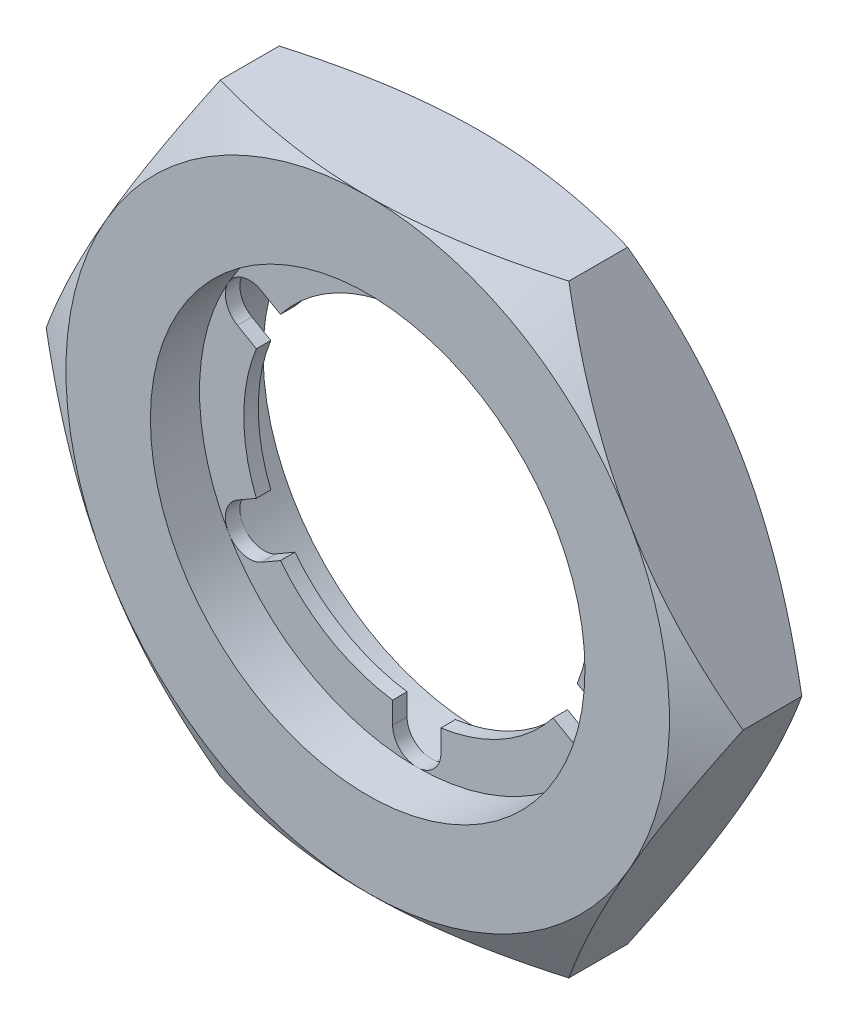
ISO-10303-21;
HEADER;
FILE_DESCRIPTION(('STEP AP214'),'2;1');
FILE_NAME('part.step','',(''),(''),'','','');
FILE_SCHEMA(('AUTOMOTIVE_DESIGN { 1 0 10303 214 1 1 1 1 }'));
ENDSEC;
DATA;
#1=APPLICATION_CONTEXT('core data for automotive mechanical design processes');
#2=APPLICATION_PROTOCOL_DEFINITION('international standard','automotive_design',2000,#1);
#3=PRODUCT_CONTEXT('',#1,'mechanical');
#4=PRODUCT('Part','Part','',(#3));
#5=PRODUCT_RELATED_PRODUCT_CATEGORY('part','',(#4));
#6=PRODUCT_DEFINITION_FORMATION('','',#4);
#7=PRODUCT_DEFINITION_CONTEXT('part definition',#1,'design');
#8=PRODUCT_DEFINITION('design','',#6,#7);
#9=PRODUCT_DEFINITION_SHAPE('','',#8);
#10=(LENGTH_UNIT() NAMED_UNIT(*) SI_UNIT(.MILLI.,.METRE.));
#11=(NAMED_UNIT(*) PLANE_ANGLE_UNIT() SI_UNIT($,.RADIAN.));
#12=(NAMED_UNIT(*) SI_UNIT($,.STERADIAN.) SOLID_ANGLE_UNIT());
#13=UNCERTAINTY_MEASURE_WITH_UNIT(LENGTH_MEASURE(1.E-05),#10,'distance_accuracy_value','');
#14=(GEOMETRIC_REPRESENTATION_CONTEXT(3) GLOBAL_UNCERTAINTY_ASSIGNED_CONTEXT((#13)) GLOBAL_UNIT_ASSIGNED_CONTEXT((#10,
#11,#12)) REPRESENTATION_CONTEXT('',''));
#15=CARTESIAN_POINT('',(0.,0.,0.));
#16=DIRECTION('',(0.,0.,1.));
#17=DIRECTION('',(1.,0.,0.));
#18=AXIS2_PLACEMENT_3D('',#15,#16,#17);
#19=CARTESIAN_POINT('',(21.650635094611,-37.5,-14.));
#20=DIRECTION('',(0.,0.,1.));
#21=DIRECTION('',(1.,0.,0.));
#22=AXIS2_PLACEMENT_3D('',#19,#20,#21);
#23=PLANE('',#22);
#24=CARTESIAN_POINT('',(0.,0.,-14.));
#25=DIRECTION('',(0.,0.,1.));
#26=DIRECTION('',(1.,0.,0.));
#27=AXIS2_PLACEMENT_3D('',#24,#25,#26);
#28=CIRCLE('',#27,37.5);
#29=CARTESIAN_POINT('',(32.4759526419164,18.75,-14.));
#30=VERTEX_POINT('',#29);
#31=CARTESIAN_POINT('',(0.,37.5,-14.));
#32=VERTEX_POINT('',#31);
#33=EDGE_CURVE('E511',#30,#32,#28,.T.);
#34=ORIENTED_EDGE('',*,*,#33,.F.);
#35=CARTESIAN_POINT('',(0.,0.,-14.));
#36=DIRECTION('',(0.,0.,1.));
#37=DIRECTION('',(1.,0.,0.));
#38=AXIS2_PLACEMENT_3D('',#35,#36,#37);
#39=CIRCLE('',#38,37.5);
#40=CARTESIAN_POINT('',(32.4759526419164,-18.75,-14.));
#41=VERTEX_POINT('',#40);
#42=EDGE_CURVE('E636',#41,#30,#39,.T.);
#43=ORIENTED_EDGE('',*,*,#42,.F.);
#44=CARTESIAN_POINT('',(0.,-37.5,-14.));
#45=VERTEX_POINT('',#44);
#46=EDGE_CURVE('E639',#45,#41,#39,.T.);
#47=ORIENTED_EDGE('',*,*,#46,.F.);
#48=CARTESIAN_POINT('',(-32.4759526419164,-18.75,-14.));
#49=VERTEX_POINT('',#48);
#50=EDGE_CURVE('E686',#49,#45,#39,.T.);
#51=ORIENTED_EDGE('',*,*,#50,.F.);
#52=CARTESIAN_POINT('',(-32.4759526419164,18.75,-14.));
#53=VERTEX_POINT('',#52);
#54=EDGE_CURVE('E1350',#53,#49,#39,.T.);
#55=ORIENTED_EDGE('',*,*,#54,.F.);
#56=EDGE_CURVE('E640',#32,#53,#39,.T.);
#57=ORIENTED_EDGE('',*,*,#56,.F.);
#58=EDGE_LOOP('',(#34,#43,#47,#51,#55,#57));
#59=FACE_BOUND('',#58,.T.);
#60=CARTESIAN_POINT('',(0.,0.,-14.));
#61=DIRECTION('',(0.,0.,1.));
#62=DIRECTION('',(1.,0.,0.));
#63=AXIS2_PLACEMENT_3D('',#60,#61,#62);
#64=CIRCLE('',#63,27.);
#65=CARTESIAN_POINT('',(27.,0.,-14.));
#66=VERTEX_POINT('',#65);
#67=EDGE_CURVE('E46',#66,#66,#64,.F.);
#68=ORIENTED_EDGE('',*,*,#67,.F.);
#69=EDGE_LOOP('',(#68));
#70=FACE_BOUND('',#69,.T.);
#71=ADVANCED_FACE('F37',(#59,#70),#23,.F.);
#72=CARTESIAN_POINT('',(0.,0.,-14.));
#73=DIRECTION('',(0.,0.,1.));
#74=DIRECTION('',(1.,0.,0.));
#75=AXIS2_PLACEMENT_3D('',#72,#73,#74);
#76=CYLINDRICAL_SURFACE('',#75,21.5);
#77=DIRECTION('',(0.,0.,1.));
#78=VECTOR('',#77,1.);
#79=CARTESIAN_POINT('',(3.00000000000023,21.2896688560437,-14.));
#80=LINE('',#79,#78);
#81=CARTESIAN_POINT('',(3.00000000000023,21.2896688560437,-7.9));
#82=VERTEX_POINT('',#81);
#83=CARTESIAN_POINT('',(3.00000000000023,21.2896688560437,-6.1));
#84=VERTEX_POINT('',#83);
#85=EDGE_CURVE('E474',#82,#84,#80,.T.);
#86=ORIENTED_EDGE('',*,*,#85,.F.);
#87=CARTESIAN_POINT('',(0.,0.,-7.9));
#88=DIRECTION('',(0.,0.,1.));
#89=DIRECTION('',(1.,0.,0.));
#90=AXIS2_PLACEMENT_3D('',#87,#88,#89);
#91=CIRCLE('',#90,21.5);
#92=CARTESIAN_POINT('',(16.9373940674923,13.2429106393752,-7.9));
#93=VERTEX_POINT('',#92);
#94=EDGE_CURVE('E933',#82,#93,#91,.F.);
#95=ORIENTED_EDGE('',*,*,#94,.T.);
#96=DIRECTION('',(0.,0.,1.));
#97=VECTOR('',#96,1.);
#98=CARTESIAN_POINT('',(16.9373940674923,13.2429106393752,-14.));
#99=LINE('',#98,#97);
#100=CARTESIAN_POINT('',(16.9373940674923,13.2429106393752,-6.1));
#101=VERTEX_POINT('',#100);
#102=EDGE_CURVE('E514',#93,#101,#99,.T.);
#103=ORIENTED_EDGE('',*,*,#102,.T.);
#104=CARTESIAN_POINT('',(0.,0.,-6.1));
#105=DIRECTION('',(0.,0.,1.));
#106=DIRECTION('',(1.,0.,0.));
#107=AXIS2_PLACEMENT_3D('',#104,#105,#106);
#108=CIRCLE('',#107,21.5);
#109=EDGE_CURVE('E414',#84,#101,#108,.F.);
#110=ORIENTED_EDGE('',*,*,#109,.F.);
#111=EDGE_LOOP('',(#86,#95,#103,#110));
#112=FACE_BOUND('',#111,.T.);
#113=ADVANCED_FACE('F648',(#112),#76,.F.);
#114=DIRECTION('',(0.,0.,1.));
#115=VECTOR('',#114,1.);
#116=CARTESIAN_POINT('',(-16.9373940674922,13.2429106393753,-14.));
#117=LINE('',#116,#115);
#118=CARTESIAN_POINT('',(-16.9373940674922,13.2429106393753,-7.9));
#119=VERTEX_POINT('',#118);
#120=CARTESIAN_POINT('',(-16.9373940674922,13.2429106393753,-6.1));
#121=VERTEX_POINT('',#120);
#122=EDGE_CURVE('E481',#119,#121,#117,.T.);
#123=ORIENTED_EDGE('',*,*,#122,.F.);
#124=CARTESIAN_POINT('',(0.,0.,-7.9));
#125=DIRECTION('',(0.,0.,1.));
#126=DIRECTION('',(1.,0.,0.));
#127=AXIS2_PLACEMENT_3D('',#124,#125,#126);
#128=CIRCLE('',#127,21.5);
#129=CARTESIAN_POINT('',(-2.99999999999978,21.2896688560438,-7.9));
#130=VERTEX_POINT('',#129);
#131=EDGE_CURVE('E866',#119,#130,#128,.F.);
#132=ORIENTED_EDGE('',*,*,#131,.T.);
#133=DIRECTION('',(0.,0.,1.));
#134=VECTOR('',#133,1.);
#135=CARTESIAN_POINT('',(-2.99999999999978,21.2896688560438,-14.));
#136=LINE('',#135,#134);
#137=CARTESIAN_POINT('',(-2.99999999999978,21.2896688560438,-6.1));
#138=VERTEX_POINT('',#137);
#139=EDGE_CURVE('E60',#130,#138,#136,.T.);
#140=ORIENTED_EDGE('',*,*,#139,.T.);
#141=CARTESIAN_POINT('',(0.,0.,-6.1));
#142=DIRECTION('',(0.,0.,1.));
#143=DIRECTION('',(1.,0.,0.));
#144=AXIS2_PLACEMENT_3D('',#141,#142,#143);
#145=CIRCLE('',#144,21.5);
#146=EDGE_CURVE('E403',#121,#138,#145,.F.);
#147=ORIENTED_EDGE('',*,*,#146,.F.);
#148=EDGE_LOOP('',(#123,#132,#140,#147));
#149=FACE_BOUND('',#148,.T.);
#150=ADVANCED_FACE('F653',(#149),#76,.F.);
#151=DIRECTION('',(0.,0.,1.));
#152=VECTOR('',#151,1.);
#153=CARTESIAN_POINT('',(-19.9373940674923,-8.04675821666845,-14.));
#154=LINE('',#153,#152);
#155=CARTESIAN_POINT('',(-19.9373940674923,-8.04675821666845,-7.9));
#156=VERTEX_POINT('',#155);
#157=CARTESIAN_POINT('',(-19.9373940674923,-8.04675821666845,-6.1));
#158=VERTEX_POINT('',#157);
#159=EDGE_CURVE('E489',#156,#158,#154,.T.);
#160=ORIENTED_EDGE('',*,*,#159,.F.);
#161=CARTESIAN_POINT('',(0.,0.,-7.9));
#162=DIRECTION('',(0.,0.,1.));
#163=DIRECTION('',(1.,0.,0.));
#164=AXIS2_PLACEMENT_3D('',#161,#162,#163);
#165=CIRCLE('',#164,21.5);
#166=CARTESIAN_POINT('',(-19.9373940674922,8.04675821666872,-7.9));
#167=VERTEX_POINT('',#166);
#168=EDGE_CURVE('E354',#156,#167,#165,.F.);
#169=ORIENTED_EDGE('',*,*,#168,.T.);
#170=DIRECTION('',(0.,0.,1.));
#171=VECTOR('',#170,1.);
#172=CARTESIAN_POINT('',(-19.9373940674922,8.04675821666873,-14.));
#173=LINE('',#172,#171);
#174=CARTESIAN_POINT('',(-19.9373940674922,8.04675821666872,-6.1));
#175=VERTEX_POINT('',#174);
#176=EDGE_CURVE('E483',#167,#175,#173,.T.);
#177=ORIENTED_EDGE('',*,*,#176,.T.);
#178=CARTESIAN_POINT('',(0.,0.,-6.1));
#179=DIRECTION('',(0.,0.,1.));
#180=DIRECTION('',(1.,0.,0.));
#181=AXIS2_PLACEMENT_3D('',#178,#179,#180);
#182=CIRCLE('',#181,21.5);
#183=EDGE_CURVE('E433',#158,#175,#182,.F.);
#184=ORIENTED_EDGE('',*,*,#183,.F.);
#185=EDGE_LOOP('',(#160,#169,#177,#184));
#186=FACE_BOUND('',#185,.T.);
#187=ADVANCED_FACE('F848',(#186),#76,.F.);
#188=DIRECTION('',(0.,0.,1.));
#189=VECTOR('',#188,1.);
#190=CARTESIAN_POINT('',(-3.00000000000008,-21.2896688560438,-14.));
#191=LINE('',#190,#189);
#192=CARTESIAN_POINT('',(-3.00000000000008,-21.2896688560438,-7.9));
#193=VERTEX_POINT('',#192);
#194=CARTESIAN_POINT('',(-3.00000000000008,-21.2896688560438,-6.1));
#195=VERTEX_POINT('',#194);
#196=EDGE_CURVE('E497',#193,#195,#191,.T.);
#197=ORIENTED_EDGE('',*,*,#196,.F.);
#198=CARTESIAN_POINT('',(0.,0.,-7.9));
#199=DIRECTION('',(0.,0.,1.));
#200=DIRECTION('',(1.,0.,0.));
#201=AXIS2_PLACEMENT_3D('',#198,#199,#200);
#202=CIRCLE('',#201,21.5);
#203=CARTESIAN_POINT('',(-16.9373940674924,-13.2429106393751,-7.9));
#204=VERTEX_POINT('',#203);
#205=EDGE_CURVE('E386',#193,#204,#202,.F.);
#206=ORIENTED_EDGE('',*,*,#205,.T.);
#207=DIRECTION('',(0.,0.,1.));
#208=VECTOR('',#207,1.);
#209=CARTESIAN_POINT('',(-16.9373940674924,-13.2429106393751,-14.));
#210=LINE('',#209,#208);
#211=CARTESIAN_POINT('',(-16.9373940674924,-13.2429106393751,-6.1));
#212=VERTEX_POINT('',#211);
#213=EDGE_CURVE('E491',#204,#212,#210,.T.);
#214=ORIENTED_EDGE('',*,*,#213,.T.);
#215=CARTESIAN_POINT('',(0.,0.,-6.1));
#216=DIRECTION('',(0.,0.,1.));
#217=DIRECTION('',(1.,0.,0.));
#218=AXIS2_PLACEMENT_3D('',#215,#216,#217);
#219=CIRCLE('',#218,21.5);
#220=EDGE_CURVE('E464',#195,#212,#219,.F.);
#221=ORIENTED_EDGE('',*,*,#220,.F.);
#222=EDGE_LOOP('',(#197,#206,#214,#221));
#223=FACE_BOUND('',#222,.T.);
#224=ADVANCED_FACE('F913',(#223),#76,.F.);
#225=DIRECTION('',(0.,0.,1.));
#226=VECTOR('',#225,1.);
#227=CARTESIAN_POINT('',(16.9373940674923,-13.2429106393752,-14.));
#228=LINE('',#227,#226);
#229=CARTESIAN_POINT('',(16.9373940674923,-13.2429106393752,-7.9));
#230=VERTEX_POINT('',#229);
#231=CARTESIAN_POINT('',(16.9373940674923,-13.2429106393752,-6.1));
#232=VERTEX_POINT('',#231);
#233=EDGE_CURVE('E504',#230,#232,#228,.T.);
#234=ORIENTED_EDGE('',*,*,#233,.F.);
#235=CARTESIAN_POINT('',(0.,0.,-7.9));
#236=DIRECTION('',(0.,0.,1.));
#237=DIRECTION('',(1.,0.,0.));
#238=AXIS2_PLACEMENT_3D('',#235,#236,#237);
#239=CIRCLE('',#238,21.5);
#240=CARTESIAN_POINT('',(2.99999999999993,-21.2896688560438,-7.9));
#241=VERTEX_POINT('',#240);
#242=EDGE_CURVE('E373',#230,#241,#239,.F.);
#243=ORIENTED_EDGE('',*,*,#242,.T.);
#244=DIRECTION('',(0.,0.,1.));
#245=VECTOR('',#244,1.);
#246=CARTESIAN_POINT('',(2.99999999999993,-21.2896688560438,-14.));
#247=LINE('',#246,#245);
#248=CARTESIAN_POINT('',(2.99999999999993,-21.2896688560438,-6.1));
#249=VERTEX_POINT('',#248);
#250=EDGE_CURVE('E499',#241,#249,#247,.T.);
#251=ORIENTED_EDGE('',*,*,#250,.T.);
#252=CARTESIAN_POINT('',(0.,0.,-6.1));
#253=DIRECTION('',(0.,0.,1.));
#254=DIRECTION('',(1.,0.,0.));
#255=AXIS2_PLACEMENT_3D('',#252,#253,#254);
#256=CIRCLE('',#255,21.5);
#257=EDGE_CURVE('E452',#232,#249,#256,.F.);
#258=ORIENTED_EDGE('',*,*,#257,.F.);
#259=EDGE_LOOP('',(#234,#243,#251,#258));
#260=FACE_BOUND('',#259,.T.);
#261=ADVANCED_FACE('F898',(#260),#76,.F.);
#262=DIRECTION('',(0.,0.,1.));
#263=VECTOR('',#262,1.);
#264=CARTESIAN_POINT('',(19.9373940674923,8.04675821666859,-14.));
#265=LINE('',#264,#263);
#266=CARTESIAN_POINT('',(19.9373940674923,8.04675821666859,-7.9));
#267=VERTEX_POINT('',#266);
#268=CARTESIAN_POINT('',(19.9373940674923,8.04675821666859,-6.1));
#269=VERTEX_POINT('',#268);
#270=EDGE_CURVE('E512',#267,#269,#265,.T.);
#271=ORIENTED_EDGE('',*,*,#270,.F.);
#272=CARTESIAN_POINT('',(0.,0.,-7.9));
#273=DIRECTION('',(0.,0.,1.));
#274=DIRECTION('',(1.,0.,0.));
#275=AXIS2_PLACEMENT_3D('',#272,#273,#274);
#276=CIRCLE('',#275,21.5);
#277=CARTESIAN_POINT('',(19.9373940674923,-8.04675821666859,-7.9));
#278=VERTEX_POINT('',#277);
#279=EDGE_CURVE('E351',#267,#278,#276,.F.);
#280=ORIENTED_EDGE('',*,*,#279,.T.);
#281=DIRECTION('',(0.,0.,1.));
#282=VECTOR('',#281,1.);
#283=CARTESIAN_POINT('',(19.9373940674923,-8.04675821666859,-14.));
#284=LINE('',#283,#282);
#285=CARTESIAN_POINT('',(19.9373940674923,-8.04675821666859,-6.1));
#286=VERTEX_POINT('',#285);
#287=EDGE_CURVE('E506',#278,#286,#284,.T.);
#288=ORIENTED_EDGE('',*,*,#287,.T.);
#289=CARTESIAN_POINT('',(0.,0.,-6.1));
#290=DIRECTION('',(0.,0.,1.));
#291=DIRECTION('',(1.,0.,0.));
#292=AXIS2_PLACEMENT_3D('',#289,#290,#291);
#293=CIRCLE('',#292,21.5);
#294=EDGE_CURVE('E430',#269,#286,#293,.F.);
#295=ORIENTED_EDGE('',*,*,#294,.F.);
#296=EDGE_LOOP('',(#271,#280,#288,#295));
#297=FACE_BOUND('',#296,.T.);
#298=ADVANCED_FACE('F655',(#297),#76,.F.);
#299=CARTESIAN_POINT('',(20.7846096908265,12.,-14.));
#300=DIRECTION('',(0.,0.,1.));
#301=DIRECTION('',(1.,0.,0.));
#302=AXIS2_PLACEMENT_3D('',#299,#300,#301);
#303=CYLINDRICAL_SURFACE('',#302,3.00000000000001);
#304=CARTESIAN_POINT('',(20.7846096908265,12.,-7.9));
#305=DIRECTION('',(0.,0.,1.));
#306=DIRECTION('',(1.,0.,0.));
#307=AXIS2_PLACEMENT_3D('',#304,#305,#306);
#308=CIRCLE('',#307,3.00000000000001);
#309=CARTESIAN_POINT('',(19.2846096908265,14.5980762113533,-7.9));
#310=VERTEX_POINT('',#309);
#311=CARTESIAN_POINT('',(23.3826859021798,13.5,-7.9));
#312=VERTEX_POINT('',#311);
#313=EDGE_CURVE('E320',#310,#312,#308,.F.);
#314=ORIENTED_EDGE('',*,*,#313,.T.);
#315=CARTESIAN_POINT('',(22.2846096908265,9.40192378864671,-7.9));
#316=VERTEX_POINT('',#315);
#317=EDGE_CURVE('E309',#312,#316,#308,.F.);
#318=ORIENTED_EDGE('',*,*,#317,.T.);
#319=DIRECTION('',(0.,0.,1.));
#320=VECTOR('',#319,1.);
#321=CARTESIAN_POINT('',(22.2846096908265,9.40192378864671,-14.));
#322=LINE('',#321,#320);
#323=CARTESIAN_POINT('',(22.2846096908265,9.40192378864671,-6.1));
#324=VERTEX_POINT('',#323);
#325=EDGE_CURVE('E509',#316,#324,#322,.T.);
#326=ORIENTED_EDGE('',*,*,#325,.T.);
#327=CARTESIAN_POINT('',(20.7846096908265,12.,-6.1));
#328=DIRECTION('',(0.,0.,1.));
#329=DIRECTION('',(1.,0.,0.));
#330=AXIS2_PLACEMENT_3D('',#327,#328,#329);
#331=CIRCLE('',#330,3.00000000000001);
#332=CARTESIAN_POINT('',(23.3826859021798,13.5,-6.1));
#333=VERTEX_POINT('',#332);
#334=EDGE_CURVE('E423',#333,#324,#331,.F.);
#335=ORIENTED_EDGE('',*,*,#334,.F.);
#336=CARTESIAN_POINT('',(19.2846096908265,14.5980762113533,-6.1));
#337=VERTEX_POINT('',#336);
#338=EDGE_CURVE('E421',#337,#333,#331,.F.);
#339=ORIENTED_EDGE('',*,*,#338,.F.);
#340=DIRECTION('',(0.,0.,1.));
#341=VECTOR('',#340,1.);
#342=CARTESIAN_POINT('',(19.2846096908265,14.5980762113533,-14.));
#343=LINE('',#342,#341);
#344=EDGE_CURVE('E342',#310,#337,#343,.T.);
#345=ORIENTED_EDGE('',*,*,#344,.F.);
#346=EDGE_LOOP('',(#314,#318,#326,#335,#339,#345));
#347=FACE_BOUND('',#346,.T.);
#348=ADVANCED_FACE('F340',(#347),#303,.F.);
#349=CARTESIAN_POINT('',(22.2846096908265,9.40192378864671,-14.));
#350=DIRECTION('',(0.5,-0.866025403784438,0.));
#351=DIRECTION('',(0.866025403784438,0.500000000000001,0.));
#352=AXIS2_PLACEMENT_3D('',#349,#350,#351);
#353=PLANE('',#352);
#354=ORIENTED_EDGE('',*,*,#325,.F.);
#355=DIRECTION('',(-0.866025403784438,-0.500000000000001,0.));
#356=VECTOR('',#355,1.);
#357=CARTESIAN_POINT('',(22.2846096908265,9.40192378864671,-7.9));
#358=LINE('',#357,#356);
#359=EDGE_CURVE('E315',#316,#267,#358,.T.);
#360=ORIENTED_EDGE('',*,*,#359,.T.);
#361=ORIENTED_EDGE('',*,*,#270,.T.);
#362=DIRECTION('',(-0.866025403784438,-0.500000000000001,0.));
#363=VECTOR('',#362,1.);
#364=CARTESIAN_POINT('',(22.2846096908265,9.40192378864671,-6.1));
#365=LINE('',#364,#363);
#366=EDGE_CURVE('E427',#324,#269,#365,.T.);
#367=ORIENTED_EDGE('',*,*,#366,.F.);
#368=EDGE_LOOP('',(#354,#360,#361,#367));
#369=FACE_BOUND('',#368,.T.);
#370=ADVANCED_FACE('F884',(#369),#353,.F.);
#371=CARTESIAN_POINT('',(19.2846096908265,14.5980762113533,-14.));
#372=DIRECTION('',(-0.500000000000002,0.866025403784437,0.));
#373=DIRECTION('',(-0.866025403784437,-0.500000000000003,0.));
#374=AXIS2_PLACEMENT_3D('',#371,#372,#373);
#375=PLANE('',#374);
#376=ORIENTED_EDGE('',*,*,#102,.F.);
#377=DIRECTION('',(0.866025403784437,0.500000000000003,0.));
#378=VECTOR('',#377,1.);
#379=CARTESIAN_POINT('',(19.2846096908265,14.5980762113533,-7.9));
#380=LINE('',#379,#378);
#381=EDGE_CURVE('E343',#93,#310,#380,.T.);
#382=ORIENTED_EDGE('',*,*,#381,.T.);
#383=ORIENTED_EDGE('',*,*,#344,.T.);
#384=DIRECTION('',(0.866025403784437,0.500000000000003,0.));
#385=VECTOR('',#384,1.);
#386=CARTESIAN_POINT('',(19.2846096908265,14.5980762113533,-6.1));
#387=LINE('',#386,#385);
#388=EDGE_CURVE('E418',#101,#337,#387,.T.);
#389=ORIENTED_EDGE('',*,*,#388,.F.);
#390=EDGE_LOOP('',(#376,#382,#383,#389));
#391=FACE_BOUND('',#390,.T.);
#392=ADVANCED_FACE('F983',(#391),#375,.F.);
#393=CARTESIAN_POINT('',(20.7846096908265,-12.,-14.));
#394=DIRECTION('',(0.,0.,1.));
#395=DIRECTION('',(1.,0.,0.));
#396=AXIS2_PLACEMENT_3D('',#393,#394,#395);
#397=CYLINDRICAL_SURFACE('',#396,3.00000000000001);
#398=CARTESIAN_POINT('',(20.7846096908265,-12.,-7.9));
#399=DIRECTION('',(0.,0.,1.));
#400=DIRECTION('',(1.,0.,0.));
#401=AXIS2_PLACEMENT_3D('',#398,#399,#400);
#402=CIRCLE('',#401,3.00000000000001);
#403=CARTESIAN_POINT('',(22.2846096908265,-9.40192378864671,-7.9));
#404=VERTEX_POINT('',#403);
#405=CARTESIAN_POINT('',(23.3826859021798,-13.5,-7.9));
#406=VERTEX_POINT('',#405);
#407=EDGE_CURVE('E367',#404,#406,#402,.F.);
#408=ORIENTED_EDGE('',*,*,#407,.T.);
#409=CARTESIAN_POINT('',(19.2846096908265,-14.5980762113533,-7.9));
#410=VERTEX_POINT('',#409);
#411=EDGE_CURVE('E369',#406,#410,#402,.F.);
#412=ORIENTED_EDGE('',*,*,#411,.T.);
#413=DIRECTION('',(0.,0.,1.));
#414=VECTOR('',#413,1.);
#415=CARTESIAN_POINT('',(19.2846096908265,-14.5980762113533,-14.));
#416=LINE('',#415,#414);
#417=CARTESIAN_POINT('',(19.2846096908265,-14.5980762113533,-6.1));
#418=VERTEX_POINT('',#417);
#419=EDGE_CURVE('E502',#410,#418,#416,.T.);
#420=ORIENTED_EDGE('',*,*,#419,.T.);
#421=CARTESIAN_POINT('',(20.7846096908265,-12.,-6.1));
#422=DIRECTION('',(0.,0.,1.));
#423=DIRECTION('',(1.,0.,0.));
#424=AXIS2_PLACEMENT_3D('',#421,#422,#423);
#425=CIRCLE('',#424,3.00000000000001);
#426=CARTESIAN_POINT('',(23.3826859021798,-13.5,-6.1));
#427=VERTEX_POINT('',#426);
#428=EDGE_CURVE('E448',#427,#418,#425,.F.);
#429=ORIENTED_EDGE('',*,*,#428,.F.);
#430=CARTESIAN_POINT('',(22.2846096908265,-9.40192378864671,-6.1));
#431=VERTEX_POINT('',#430);
#432=EDGE_CURVE('E446',#431,#427,#425,.F.);
#433=ORIENTED_EDGE('',*,*,#432,.F.);
#434=DIRECTION('',(0.,0.,1.));
#435=VECTOR('',#434,1.);
#436=CARTESIAN_POINT('',(22.2846096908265,-9.40192378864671,-14.));
#437=LINE('',#436,#435);
#438=EDGE_CURVE('E496',#404,#431,#437,.T.);
#439=ORIENTED_EDGE('',*,*,#438,.F.);
#440=EDGE_LOOP('',(#408,#412,#420,#429,#433,#439));
#441=FACE_BOUND('',#440,.T.);
#442=ADVANCED_FACE('F818',(#441),#397,.F.);
#443=CARTESIAN_POINT('',(19.2846096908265,-14.5980762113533,-14.));
#444=DIRECTION('',(-0.500000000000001,-0.866025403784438,0.));
#445=DIRECTION('',(0.866025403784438,-0.500000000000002,0.));
#446=AXIS2_PLACEMENT_3D('',#443,#444,#445);
#447=PLANE('',#446);
#448=ORIENTED_EDGE('',*,*,#419,.F.);
#449=DIRECTION('',(-0.866025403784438,0.500000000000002,0.));
#450=VECTOR('',#449,1.);
#451=CARTESIAN_POINT('',(19.2846096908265,-14.5980762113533,-7.9));
#452=LINE('',#451,#450);
#453=EDGE_CURVE('E370',#410,#230,#452,.T.);
#454=ORIENTED_EDGE('',*,*,#453,.T.);
#455=ORIENTED_EDGE('',*,*,#233,.T.);
#456=DIRECTION('',(-0.866025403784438,0.500000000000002,0.));
#457=VECTOR('',#456,1.);
#458=CARTESIAN_POINT('',(19.2846096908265,-14.5980762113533,-6.1));
#459=LINE('',#458,#457);
#460=EDGE_CURVE('E449',#418,#232,#459,.T.);
#461=ORIENTED_EDGE('',*,*,#460,.F.);
#462=EDGE_LOOP('',(#448,#454,#455,#461));
#463=FACE_BOUND('',#462,.T.);
#464=ADVANCED_FACE('F893',(#463),#447,.F.);
#465=CARTESIAN_POINT('',(22.2846096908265,-9.40192378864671,-14.));
#466=DIRECTION('',(0.499999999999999,0.866025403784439,0.));
#467=DIRECTION('',(-0.866025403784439,0.5,0.));
#468=AXIS2_PLACEMENT_3D('',#465,#466,#467);
#469=PLANE('',#468);
#470=ORIENTED_EDGE('',*,*,#287,.F.);
#471=DIRECTION('',(0.866025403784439,-0.5,0.));
#472=VECTOR('',#471,1.);
#473=CARTESIAN_POINT('',(22.2846096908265,-9.40192378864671,-7.9));
#474=LINE('',#473,#472);
#475=EDGE_CURVE('E363',#278,#404,#474,.T.);
#476=ORIENTED_EDGE('',*,*,#475,.T.);
#477=ORIENTED_EDGE('',*,*,#438,.T.);
#478=DIRECTION('',(0.866025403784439,-0.5,0.));
#479=VECTOR('',#478,1.);
#480=CARTESIAN_POINT('',(22.2846096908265,-9.40192378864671,-6.1));
#481=LINE('',#480,#479);
#482=EDGE_CURVE('E442',#286,#431,#481,.T.);
#483=ORIENTED_EDGE('',*,*,#482,.F.);
#484=EDGE_LOOP('',(#470,#476,#477,#483));
#485=FACE_BOUND('',#484,.T.);
#486=ADVANCED_FACE('F890',(#485),#469,.F.);
#487=CARTESIAN_POINT('',(0.,-24.,-14.));
#488=DIRECTION('',(0.,0.,1.));
#489=DIRECTION('',(1.,0.,0.));
#490=AXIS2_PLACEMENT_3D('',#487,#488,#489);
#491=CYLINDRICAL_SURFACE('',#490,3.00000000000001);
#492=CARTESIAN_POINT('',(0.,-24.,-7.9));
#493=DIRECTION('',(0.,0.,1.));
#494=DIRECTION('',(1.,0.,0.));
#495=AXIS2_PLACEMENT_3D('',#492,#493,#494);
#496=CIRCLE('',#495,3.00000000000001);
#497=CARTESIAN_POINT('',(2.99999999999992,-24.,-7.9));
#498=VERTEX_POINT('',#497);
#499=CARTESIAN_POINT('',(0.,-27.,-7.9));
#500=VERTEX_POINT('',#499);
#501=EDGE_CURVE('E382',#498,#500,#496,.F.);
#502=ORIENTED_EDGE('',*,*,#501,.T.);
#503=CARTESIAN_POINT('',(-3.00000000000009,-24.,-7.9));
#504=VERTEX_POINT('',#503);
#505=EDGE_CURVE('E385',#500,#504,#496,.F.);
#506=ORIENTED_EDGE('',*,*,#505,.T.);
#507=DIRECTION('',(0.,0.,1.));
#508=VECTOR('',#507,1.);
#509=CARTESIAN_POINT('',(-3.00000000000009,-24.,-14.));
#510=LINE('',#509,#508);
#511=CARTESIAN_POINT('',(-3.00000000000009,-24.,-6.1));
#512=VERTEX_POINT('',#511);
#513=EDGE_CURVE('E494',#504,#512,#510,.T.);
#514=ORIENTED_EDGE('',*,*,#513,.T.);
#515=CARTESIAN_POINT('',(0.,-24.,-6.1));
#516=DIRECTION('',(0.,0.,1.));
#517=DIRECTION('',(1.,0.,0.));
#518=AXIS2_PLACEMENT_3D('',#515,#516,#517);
#519=CIRCLE('',#518,3.00000000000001);
#520=CARTESIAN_POINT('',(0.,-27.,-6.1));
#521=VERTEX_POINT('',#520);
#522=EDGE_CURVE('E463',#521,#512,#519,.F.);
#523=ORIENTED_EDGE('',*,*,#522,.F.);
#524=CARTESIAN_POINT('',(2.99999999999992,-24.,-6.1));
#525=VERTEX_POINT('',#524);
#526=EDGE_CURVE('E461',#525,#521,#519,.F.);
#527=ORIENTED_EDGE('',*,*,#526,.F.);
#528=DIRECTION('',(0.,0.,1.));
#529=VECTOR('',#528,1.);
#530=CARTESIAN_POINT('',(2.99999999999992,-24.,-14.));
#531=LINE('',#530,#529);
#532=EDGE_CURVE('E488',#498,#525,#531,.T.);
#533=ORIENTED_EDGE('',*,*,#532,.F.);
#534=EDGE_LOOP('',(#502,#506,#514,#523,#527,#533));
#535=FACE_BOUND('',#534,.T.);
#536=ADVANCED_FACE('F904',(#535),#491,.F.);
#537=CARTESIAN_POINT('',(-3.00000000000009,-24.,-14.));
#538=DIRECTION('',(-1.,0.,0.));
#539=DIRECTION('',(0.,-1.,0.));
#540=AXIS2_PLACEMENT_3D('',#537,#538,#539);
#541=PLANE('',#540);
#542=ORIENTED_EDGE('',*,*,#513,.F.);
#543=DIRECTION('',(0.,1.,0.));
#544=VECTOR('',#543,1.);
#545=CARTESIAN_POINT('',(-3.00000000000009,-24.,-7.9));
#546=LINE('',#545,#544);
#547=EDGE_CURVE('E389',#504,#193,#546,.T.);
#548=ORIENTED_EDGE('',*,*,#547,.T.);
#549=ORIENTED_EDGE('',*,*,#196,.T.);
#550=DIRECTION('',(0.,1.,0.));
#551=VECTOR('',#550,1.);
#552=CARTESIAN_POINT('',(-3.00000000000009,-24.,-6.1));
#553=LINE('',#552,#551);
#554=EDGE_CURVE('E467',#512,#195,#553,.T.);
#555=ORIENTED_EDGE('',*,*,#554,.F.);
#556=EDGE_LOOP('',(#542,#548,#549,#555));
#557=FACE_BOUND('',#556,.T.);
#558=ADVANCED_FACE('F910',(#557),#541,.F.);
#559=CARTESIAN_POINT('',(2.99999999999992,-24.,-14.));
#560=DIRECTION('',(1.,0.,0.));
#561=DIRECTION('',(0.,1.,0.));
#562=AXIS2_PLACEMENT_3D('',#559,#560,#561);
#563=PLANE('',#562);
#564=ORIENTED_EDGE('',*,*,#250,.F.);
#565=DIRECTION('',(0.,-1.,0.));
#566=VECTOR('',#565,1.);
#567=CARTESIAN_POINT('',(2.99999999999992,-24.,-7.9));
#568=LINE('',#567,#566);
#569=EDGE_CURVE('E379',#241,#498,#568,.T.);
#570=ORIENTED_EDGE('',*,*,#569,.T.);
#571=ORIENTED_EDGE('',*,*,#532,.T.);
#572=DIRECTION('',(0.,-1.,0.));
#573=VECTOR('',#572,1.);
#574=CARTESIAN_POINT('',(2.99999999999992,-24.,-6.1));
#575=LINE('',#574,#573);
#576=EDGE_CURVE('E458',#249,#525,#575,.T.);
#577=ORIENTED_EDGE('',*,*,#576,.F.);
#578=EDGE_LOOP('',(#564,#570,#571,#577));
#579=FACE_BOUND('',#578,.T.);
#580=ADVANCED_FACE('F901',(#579),#563,.F.);
#581=CARTESIAN_POINT('',(-20.7846096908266,-11.9999999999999,-14.));
#582=DIRECTION('',(0.,0.,1.));
#583=DIRECTION('',(1.,0.,0.));
#584=AXIS2_PLACEMENT_3D('',#581,#582,#583);
#585=CYLINDRICAL_SURFACE('',#584,3.00000000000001);
#586=CARTESIAN_POINT('',(-20.7846096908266,-11.9999999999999,-7.9));
#587=DIRECTION('',(0.,0.,1.));
#588=DIRECTION('',(1.,0.,0.));
#589=AXIS2_PLACEMENT_3D('',#586,#587,#588);
#590=CIRCLE('',#589,3.00000000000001);
#591=CARTESIAN_POINT('',(-19.2846096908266,-14.5980762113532,-7.9));
#592=VERTEX_POINT('',#591);
#593=CARTESIAN_POINT('',(-23.3826859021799,-13.4999999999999,-7.9));
#594=VERTEX_POINT('',#593);
#595=EDGE_CURVE('E364',#592,#594,#590,.F.);
#596=ORIENTED_EDGE('',*,*,#595,.T.);
#597=CARTESIAN_POINT('',(-22.2846096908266,-9.40192378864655,-7.9));
#598=VERTEX_POINT('',#597);
#599=EDGE_CURVE('E360',#594,#598,#590,.F.);
#600=ORIENTED_EDGE('',*,*,#599,.T.);
#601=DIRECTION('',(0.,0.,1.));
#602=VECTOR('',#601,1.);
#603=CARTESIAN_POINT('',(-22.2846096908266,-9.40192378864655,-14.));
#604=LINE('',#603,#602);
#605=CARTESIAN_POINT('',(-22.2846096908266,-9.40192378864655,-6.1));
#606=VERTEX_POINT('',#605);
#607=EDGE_CURVE('E486',#598,#606,#604,.T.);
#608=ORIENTED_EDGE('',*,*,#607,.T.);
#609=CARTESIAN_POINT('',(-20.7846096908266,-11.9999999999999,-6.1));
#610=DIRECTION('',(0.,0.,1.));
#611=DIRECTION('',(1.,0.,0.));
#612=AXIS2_PLACEMENT_3D('',#609,#610,#611);
#613=CIRCLE('',#612,3.00000000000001);
#614=CARTESIAN_POINT('',(-23.3826859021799,-13.4999999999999,-6.1));
#615=VERTEX_POINT('',#614);
#616=EDGE_CURVE('E439',#615,#606,#613,.F.);
#617=ORIENTED_EDGE('',*,*,#616,.F.);
#618=CARTESIAN_POINT('',(-19.2846096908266,-14.5980762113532,-6.1));
#619=VERTEX_POINT('',#618);
#620=EDGE_CURVE('E443',#619,#615,#613,.F.);
#621=ORIENTED_EDGE('',*,*,#620,.F.);
#622=DIRECTION('',(0.,0.,1.));
#623=VECTOR('',#622,1.);
#624=CARTESIAN_POINT('',(-19.2846096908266,-14.5980762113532,-14.));
#625=LINE('',#624,#623);
#626=EDGE_CURVE('E480',#592,#619,#625,.T.);
#627=ORIENTED_EDGE('',*,*,#626,.F.);
#628=EDGE_LOOP('',(#596,#600,#608,#617,#621,#627));
#629=FACE_BOUND('',#628,.T.);
#630=ADVANCED_FACE('F840',(#629),#585,.F.);
#631=CARTESIAN_POINT('',(-22.2846096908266,-9.40192378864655,-14.));
#632=DIRECTION('',(-0.499999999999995,0.866025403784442,0.));
#633=DIRECTION('',(-0.866025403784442,-0.499999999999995,0.));
#634=AXIS2_PLACEMENT_3D('',#631,#632,#633);
#635=PLANE('',#634);
#636=ORIENTED_EDGE('',*,*,#607,.F.);
#637=DIRECTION('',(0.866025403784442,0.499999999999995,0.));
#638=VECTOR('',#637,1.);
#639=CARTESIAN_POINT('',(-22.2846096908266,-9.40192378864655,-7.9));
#640=LINE('',#639,#638);
#641=EDGE_CURVE('E357',#598,#156,#640,.T.);
#642=ORIENTED_EDGE('',*,*,#641,.T.);
#643=ORIENTED_EDGE('',*,*,#159,.T.);
#644=DIRECTION('',(0.866025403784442,0.499999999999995,0.));
#645=VECTOR('',#644,1.);
#646=CARTESIAN_POINT('',(-22.2846096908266,-9.40192378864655,-6.1));
#647=LINE('',#646,#645);
#648=EDGE_CURVE('E436',#606,#158,#647,.T.);
#649=ORIENTED_EDGE('',*,*,#648,.F.);
#650=EDGE_LOOP('',(#636,#642,#643,#649));
#651=FACE_BOUND('',#650,.T.);
#652=ADVANCED_FACE('F843',(#651),#635,.F.);
#653=CARTESIAN_POINT('',(-19.2846096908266,-14.5980762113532,-14.));
#654=DIRECTION('',(0.499999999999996,-0.866025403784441,0.));
#655=DIRECTION('',(0.866025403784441,0.499999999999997,0.));
#656=AXIS2_PLACEMENT_3D('',#653,#654,#655);
#657=PLANE('',#656);
#658=ORIENTED_EDGE('',*,*,#213,.F.);
#659=DIRECTION('',(-0.866025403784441,-0.499999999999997,0.));
#660=VECTOR('',#659,1.);
#661=CARTESIAN_POINT('',(-19.2846096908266,-14.5980762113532,-7.9));
#662=LINE('',#661,#660);
#663=EDGE_CURVE('E376',#204,#592,#662,.T.);
#664=ORIENTED_EDGE('',*,*,#663,.T.);
#665=ORIENTED_EDGE('',*,*,#626,.T.);
#666=DIRECTION('',(-0.866025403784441,-0.499999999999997,0.));
#667=VECTOR('',#666,1.);
#668=CARTESIAN_POINT('',(-19.2846096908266,-14.5980762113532,-6.1));
#669=LINE('',#668,#667);
#670=EDGE_CURVE('E455',#212,#619,#669,.T.);
#671=ORIENTED_EDGE('',*,*,#670,.F.);
#672=EDGE_LOOP('',(#658,#664,#665,#671));
#673=FACE_BOUND('',#672,.T.);
#674=ADVANCED_FACE('F916',(#673),#657,.F.);
#675=CARTESIAN_POINT('',(-20.7846096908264,12.0000000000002,-14.));
#676=DIRECTION('',(0.,0.,1.));
#677=DIRECTION('',(1.,0.,0.));
#678=AXIS2_PLACEMENT_3D('',#675,#676,#677);
#679=CYLINDRICAL_SURFACE('',#678,3.00000000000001);
#680=CARTESIAN_POINT('',(-20.7846096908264,12.0000000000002,-7.9));
#681=DIRECTION('',(0.,0.,1.));
#682=DIRECTION('',(1.,0.,0.));
#683=AXIS2_PLACEMENT_3D('',#680,#681,#682);
#684=CIRCLE('',#683,3.00000000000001);
#685=CARTESIAN_POINT('',(-22.2846096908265,9.40192378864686,-7.9));
#686=VERTEX_POINT('',#685);
#687=CARTESIAN_POINT('',(-23.3826859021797,13.5000000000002,-7.9));
#688=VERTEX_POINT('',#687);
#689=EDGE_CURVE('E344',#686,#688,#684,.F.);
#690=ORIENTED_EDGE('',*,*,#689,.T.);
#691=CARTESIAN_POINT('',(-19.2846096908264,14.5980762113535,-7.9));
#692=VERTEX_POINT('',#691);
#693=EDGE_CURVE('E932',#688,#692,#684,.F.);
#694=ORIENTED_EDGE('',*,*,#693,.T.);
#695=DIRECTION('',(0.,0.,1.));
#696=VECTOR('',#695,1.);
#697=CARTESIAN_POINT('',(-19.2846096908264,14.5980762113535,-14.));
#698=LINE('',#697,#696);
#699=CARTESIAN_POINT('',(-19.2846096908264,14.5980762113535,-6.1));
#700=VERTEX_POINT('',#699);
#701=EDGE_CURVE('E478',#692,#700,#698,.T.);
#702=ORIENTED_EDGE('',*,*,#701,.T.);
#703=CARTESIAN_POINT('',(-20.7846096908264,12.0000000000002,-6.1));
#704=DIRECTION('',(0.,0.,1.));
#705=DIRECTION('',(1.,0.,0.));
#706=AXIS2_PLACEMENT_3D('',#703,#704,#705);
#707=CIRCLE('',#706,3.00000000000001);
#708=CARTESIAN_POINT('',(-23.3826859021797,13.5000000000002,-6.1));
#709=VERTEX_POINT('',#708);
#710=EDGE_CURVE('E411',#709,#700,#707,.F.);
#711=ORIENTED_EDGE('',*,*,#710,.F.);
#712=CARTESIAN_POINT('',(-22.2846096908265,9.40192378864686,-6.1));
#713=VERTEX_POINT('',#712);
#714=EDGE_CURVE('E415',#713,#709,#707,.F.);
#715=ORIENTED_EDGE('',*,*,#714,.F.);
#716=DIRECTION('',(0.,0.,1.));
#717=VECTOR('',#716,1.);
#718=CARTESIAN_POINT('',(-22.2846096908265,9.40192378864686,-14.));
#719=LINE('',#718,#717);
#720=EDGE_CURVE('E473',#686,#713,#719,.T.);
#721=ORIENTED_EDGE('',*,*,#720,.F.);
#722=EDGE_LOOP('',(#690,#694,#702,#711,#715,#721));
#723=FACE_BOUND('',#722,.T.);
#724=ADVANCED_FACE('F855',(#723),#679,.F.);
#725=CARTESIAN_POINT('',(-19.2846096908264,14.5980762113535,-14.));
#726=DIRECTION('',(0.500000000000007,0.866025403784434,0.));
#727=DIRECTION('',(-0.866025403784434,0.500000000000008,0.));
#728=AXIS2_PLACEMENT_3D('',#725,#726,#727);
#729=PLANE('',#728);
#730=ORIENTED_EDGE('',*,*,#701,.F.);
#731=DIRECTION('',(0.866025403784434,-0.500000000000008,0.));
#732=VECTOR('',#731,1.);
#733=CARTESIAN_POINT('',(-19.2846096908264,14.5980762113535,-7.9));
#734=LINE('',#733,#732);
#735=EDGE_CURVE('E865',#692,#119,#734,.T.);
#736=ORIENTED_EDGE('',*,*,#735,.T.);
#737=ORIENTED_EDGE('',*,*,#122,.T.);
#738=DIRECTION('',(0.866025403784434,-0.500000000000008,0.));
#739=VECTOR('',#738,1.);
#740=CARTESIAN_POINT('',(-19.2846096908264,14.5980762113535,-6.1));
#741=LINE('',#740,#739);
#742=EDGE_CURVE('E408',#700,#121,#741,.T.);
#743=ORIENTED_EDGE('',*,*,#742,.F.);
#744=EDGE_LOOP('',(#730,#736,#737,#743));
#745=FACE_BOUND('',#744,.T.);
#746=ADVANCED_FACE('F862',(#745),#729,.F.);
#747=CARTESIAN_POINT('',(-22.2846096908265,9.40192378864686,-14.));
#748=DIRECTION('',(-0.500000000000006,-0.866025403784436,0.));
#749=DIRECTION('',(0.866025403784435,-0.500000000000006,0.));
#750=AXIS2_PLACEMENT_3D('',#747,#748,#749);
#751=PLANE('',#750);
#752=ORIENTED_EDGE('',*,*,#176,.F.);
#753=DIRECTION('',(-0.866025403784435,0.500000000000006,0.));
#754=VECTOR('',#753,1.);
#755=CARTESIAN_POINT('',(-22.2846096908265,9.40192378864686,-7.9));
#756=LINE('',#755,#754);
#757=EDGE_CURVE('E319',#167,#686,#756,.T.);
#758=ORIENTED_EDGE('',*,*,#757,.T.);
#759=ORIENTED_EDGE('',*,*,#720,.T.);
#760=DIRECTION('',(-0.866025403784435,0.500000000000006,0.));
#761=VECTOR('',#760,1.);
#762=CARTESIAN_POINT('',(-22.2846096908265,9.40192378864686,-6.1));
#763=LINE('',#762,#761);
#764=EDGE_CURVE('E424',#175,#713,#763,.T.);
#765=ORIENTED_EDGE('',*,*,#764,.F.);
#766=EDGE_LOOP('',(#752,#758,#759,#765));
#767=FACE_BOUND('',#766,.T.);
#768=ADVANCED_FACE('F851',(#767),#751,.F.);
#769=CARTESIAN_POINT('',(2.51534904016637E-13,24.,-14.));
#770=DIRECTION('',(0.,0.,1.));
#771=DIRECTION('',(1.,0.,0.));
#772=AXIS2_PLACEMENT_3D('',#769,#770,#771);
#773=CYLINDRICAL_SURFACE('',#772,3.00000000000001);
#774=CARTESIAN_POINT('',(2.51534904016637E-13,24.,-7.9));
#775=DIRECTION('',(0.,0.,1.));
#776=DIRECTION('',(1.,0.,0.));
#777=AXIS2_PLACEMENT_3D('',#774,#775,#776);
#778=CIRCLE('',#777,3.00000000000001);
#779=CARTESIAN_POINT('',(-2.99999999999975,24.,-7.9));
#780=VERTEX_POINT('',#779);
#781=CARTESIAN_POINT('',(2.82976767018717E-13,27.,-7.9));
#782=VERTEX_POINT('',#781);
#783=EDGE_CURVE('E53',#780,#782,#778,.F.);
#784=ORIENTED_EDGE('',*,*,#783,.T.);
#785=CARTESIAN_POINT('',(3.00000000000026,24.,-7.9));
#786=VERTEX_POINT('',#785);
#787=EDGE_CURVE('E337',#782,#786,#778,.F.);
#788=ORIENTED_EDGE('',*,*,#787,.T.);
#789=DIRECTION('',(0.,0.,1.));
#790=VECTOR('',#789,1.);
#791=CARTESIAN_POINT('',(3.00000000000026,24.,-14.));
#792=LINE('',#791,#790);
#793=CARTESIAN_POINT('',(3.00000000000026,24.,-6.1));
#794=VERTEX_POINT('',#793);
#795=EDGE_CURVE('E471',#786,#794,#792,.T.);
#796=ORIENTED_EDGE('',*,*,#795,.T.);
#797=CARTESIAN_POINT('',(2.51534904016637E-13,24.,-6.1));
#798=DIRECTION('',(0.,0.,1.));
#799=DIRECTION('',(1.,0.,0.));
#800=AXIS2_PLACEMENT_3D('',#797,#798,#799);
#801=CIRCLE('',#800,3.00000000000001);
#802=CARTESIAN_POINT('',(2.82976767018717E-13,27.,-6.1));
#803=VERTEX_POINT('',#802);
#804=EDGE_CURVE('E402',#803,#794,#801,.F.);
#805=ORIENTED_EDGE('',*,*,#804,.F.);
#806=CARTESIAN_POINT('',(-2.99999999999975,24.,-6.1));
#807=VERTEX_POINT('',#806);
#808=EDGE_CURVE('E399',#807,#803,#801,.F.);
#809=ORIENTED_EDGE('',*,*,#808,.F.);
#810=DIRECTION('',(0.,0.,1.));
#811=VECTOR('',#810,1.);
#812=CARTESIAN_POINT('',(-2.99999999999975,24.,-14.));
#813=LINE('',#812,#811);
#814=EDGE_CURVE('E470',#780,#807,#813,.T.);
#815=ORIENTED_EDGE('',*,*,#814,.F.);
#816=EDGE_LOOP('',(#784,#788,#796,#805,#809,#815));
#817=FACE_BOUND('',#816,.T.);
#818=ADVANCED_FACE('F873',(#817),#773,.F.);
#819=CARTESIAN_POINT('',(3.00000000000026,24.,-14.));
#820=DIRECTION('',(1.,0.,0.));
#821=DIRECTION('',(0.,1.,0.));
#822=AXIS2_PLACEMENT_3D('',#819,#820,#821);
#823=PLANE('',#822);
#824=ORIENTED_EDGE('',*,*,#795,.F.);
#825=DIRECTION('',(0.,-1.,0.));
#826=VECTOR('',#825,1.);
#827=CARTESIAN_POINT('',(3.00000000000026,24.,-7.9));
#828=LINE('',#827,#826);
#829=EDGE_CURVE('E928',#786,#82,#828,.T.);
#830=ORIENTED_EDGE('',*,*,#829,.T.);
#831=ORIENTED_EDGE('',*,*,#85,.T.);
#832=DIRECTION('',(0.,-1.,0.));
#833=VECTOR('',#832,1.);
#834=CARTESIAN_POINT('',(3.00000000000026,24.,-6.1));
#835=LINE('',#834,#833);
#836=EDGE_CURVE('E405',#794,#84,#835,.T.);
#837=ORIENTED_EDGE('',*,*,#836,.F.);
#838=EDGE_LOOP('',(#824,#830,#831,#837));
#839=FACE_BOUND('',#838,.T.);
#840=ADVANCED_FACE('F951',(#839),#823,.F.);
#841=CARTESIAN_POINT('',(-2.99999999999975,24.,-14.));
#842=DIRECTION('',(-1.,0.,0.));
#843=DIRECTION('',(0.,-1.,0.));
#844=AXIS2_PLACEMENT_3D('',#841,#842,#843);
#845=PLANE('',#844);
#846=ORIENTED_EDGE('',*,*,#139,.F.);
#847=DIRECTION('',(0.,1.,0.));
#848=VECTOR('',#847,1.);
#849=CARTESIAN_POINT('',(-2.99999999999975,24.,-7.9));
#850=LINE('',#849,#848);
#851=EDGE_CURVE('E12',#130,#780,#850,.T.);
#852=ORIENTED_EDGE('',*,*,#851,.T.);
#853=ORIENTED_EDGE('',*,*,#814,.T.);
#854=DIRECTION('',(0.,1.,0.));
#855=VECTOR('',#854,1.);
#856=CARTESIAN_POINT('',(-2.99999999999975,24.,-6.1));
#857=LINE('',#856,#855);
#858=EDGE_CURVE('E641',#138,#807,#857,.T.);
#859=ORIENTED_EDGE('',*,*,#858,.F.);
#860=EDGE_LOOP('',(#846,#852,#853,#859));
#861=FACE_BOUND('',#860,.T.);
#862=ADVANCED_FACE('F870',(#861),#845,.F.);
#863=CARTESIAN_POINT('',(-21.650635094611,-37.5,-14.));
#864=DIRECTION('',(0.,-1.,0.));
#865=DIRECTION('',(0.,0.,-1.));
#866=AXIS2_PLACEMENT_3D('',#863,#864,#865);
#867=PLANE('',#866);
#868=DIRECTION('',(0.,0.,1.));
#869=VECTOR('',#868,1.);
#870=CARTESIAN_POINT('',(-21.650635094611,-37.5,-14.));
#871=LINE('',#870,#869);
#872=CARTESIAN_POINT('',(-21.6506350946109,-37.5,-10.650635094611));
#873=VERTEX_POINT('',#872);
#874=CARTESIAN_POINT('',(-21.6506350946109,-37.5,-3.34936490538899));
#875=VERTEX_POINT('',#874);
#876=EDGE_CURVE('E619',#873,#875,#871,.T.);
#877=ORIENTED_EDGE('',*,*,#876,.F.);
#878=CARTESIAN_POINT('',(-57.4206749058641,-37.5,3.94475144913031));
#879=CARTESIAN_POINT('',(-56.5974749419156,-37.5,3.54683300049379));
#880=CARTESIAN_POINT('',(-55.773279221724,-37.5,3.15096730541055));
#881=CARTESIAN_POINT('',(-54.1226875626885,-37.5,2.36382748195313));
#882=CARTESIAN_POINT('',(-53.2962915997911,-37.5,1.97255340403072));
#883=CARTESIAN_POINT('',(-51.6409683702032,-37.5,1.19502566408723));
#884=CARTESIAN_POINT('',(-50.8120406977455,-37.5,0.808772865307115));
#885=CARTESIAN_POINT('',(-49.1515694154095,-37.5,0.041933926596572));
#886=CARTESIAN_POINT('',(-48.320025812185,-37.5,-0.338652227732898));
#887=CARTESIAN_POINT('',(-46.6493005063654,-37.5,-1.09566599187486));
#888=CARTESIAN_POINT('',(-45.8101023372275,-37.5,-1.47205728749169));
#889=CARTESIAN_POINT('',(-44.1285321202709,-37.5,-2.2176804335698));
#890=CARTESIAN_POINT('',(-43.2861600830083,-37.5,-2.58691230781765));
#891=CARTESIAN_POINT('',(-41.5979696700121,-37.5,-3.31732562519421));
#892=CARTESIAN_POINT('',(-40.7521514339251,-37.5,-3.67850739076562));
#893=CARTESIAN_POINT('',(-39.0567145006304,-37.5,-4.39182342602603));
#894=CARTESIAN_POINT('',(-38.2070958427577,-37.5,-4.74395778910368));
#895=CARTESIAN_POINT('',(-36.4932275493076,-37.5,-5.44228899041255));
#896=CARTESIAN_POINT('',(-35.6289264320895,-37.5,-5.78835966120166));
#897=CARTESIAN_POINT('',(-33.8956690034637,-37.5,-6.46866336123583));
#898=CARTESIAN_POINT('',(-33.0267126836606,-37.5,-6.80289636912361));
#899=CARTESIAN_POINT('',(-31.283633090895,-37.5,-7.45797710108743));
#900=CARTESIAN_POINT('',(-30.4095091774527,-37.5,-7.77882312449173));
#901=CARTESIAN_POINT('',(-28.6558090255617,-37.5,-8.40526337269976));
#902=CARTESIAN_POINT('',(-27.7762328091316,-37.5,-8.71085765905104));
#903=CARTESIAN_POINT('',(-26.0131245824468,-37.5,-9.30409481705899));
#904=CARTESIAN_POINT('',(-25.1296051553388,-37.5,-9.59177489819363));
#905=CARTESIAN_POINT('',(-23.3564503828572,-37.5,-10.147566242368));
#906=CARTESIAN_POINT('',(-22.4668149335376,-37.5,-10.4156771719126));
#907=CARTESIAN_POINT('',(-19.7887429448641,-37.5,-11.1867233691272));
#908=CARTESIAN_POINT('',(-17.9904613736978,-37.5,-11.6566046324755));
#909=CARTESIAN_POINT('',(-15.2737606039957,-37.5,-12.277953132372));
#910=CARTESIAN_POINT('',(-14.3647877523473,-37.5,-12.471188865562));
#911=CARTESIAN_POINT('',(-12.5407843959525,-37.5,-12.8267850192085));
#912=CARTESIAN_POINT('',(-11.6257540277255,-37.5,-12.9891461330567));
#913=CARTESIAN_POINT('',(-9.79025980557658,-37.5,-13.2801145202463));
#914=CARTESIAN_POINT('',(-8.86979562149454,-37.5,-13.4087197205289));
#915=CARTESIAN_POINT('',(-7.02448558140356,-37.5,-13.6295931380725));
#916=CARTESIAN_POINT('',(-6.09963972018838,-37.5,-13.7218613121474));
#917=CARTESIAN_POINT('',(-4.25278774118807,-37.5,-13.867577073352));
#918=CARTESIAN_POINT('',(-3.33080090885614,-37.5,-13.9212675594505));
#919=CARTESIAN_POINT('',(-1.48538244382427,-37.5,-13.9895443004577));
#920=CARTESIAN_POINT('',(-0.561950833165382,-37.5,-14.0041311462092));
#921=CARTESIAN_POINT('',(1.28443206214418,-37.5,-13.993859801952));
#922=CARTESIAN_POINT('',(2.20738340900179,-37.5,-13.9690125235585));
#923=CARTESIAN_POINT('',(4.05146194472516,-37.5,-13.8804715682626));
#924=CARTESIAN_POINT('',(4.97258905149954,-37.5,-13.816776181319));
#925=CARTESIAN_POINT('',(6.54819621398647,-37.5,-13.675586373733));
#926=CARTESIAN_POINT('',(7.20351646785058,-37.5,-13.6072632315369));
#927=CARTESIAN_POINT('',(8.51199985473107,-37.5,-13.4523318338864));
#928=CARTESIAN_POINT('',(9.16516292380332,-37.5,-13.3657230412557));
#929=CARTESIAN_POINT('',(11.1209393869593,-37.5,-13.0797437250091));
#930=CARTESIAN_POINT('',(12.4197924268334,-37.5,-12.8542246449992));
#931=CARTESIAN_POINT('',(15.0078790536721,-37.5,-12.3410909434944));
#932=CARTESIAN_POINT('',(16.2970857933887,-37.5,-12.0533432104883));
#933=CARTESIAN_POINT('',(18.8623268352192,-37.5,-11.4246958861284));
#934=CARTESIAN_POINT('',(20.1383616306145,-37.5,-11.083798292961));
#935=CARTESIAN_POINT('',(22.7072709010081,-37.5,-10.3484850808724));
#936=CARTESIAN_POINT('',(23.9998370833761,-37.5,-9.95300062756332));
#937=CARTESIAN_POINT('',(26.5723264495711,-37.5,-9.12265731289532));
#938=CARTESIAN_POINT('',(27.8522484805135,-37.5,-8.68779489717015));
#939=CARTESIAN_POINT('',(29.7597722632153,-37.5,-8.01223012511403));
#940=CARTESIAN_POINT('',(30.391778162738,-37.5,-7.78384384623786));
#941=CARTESIAN_POINT('',(31.6530747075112,-37.5,-7.31966906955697));
#942=CARTESIAN_POINT('',(32.2823653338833,-37.5,-7.0838805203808));
#943=CARTESIAN_POINT('',(33.5381582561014,-37.5,-6.60563934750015));
#944=CARTESIAN_POINT('',(34.1646614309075,-37.5,-6.36318902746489));
#945=CARTESIAN_POINT('',(35.4152287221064,-37.5,-5.87212618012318));
#946=CARTESIAN_POINT('',(36.0392929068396,-37.5,-5.62351382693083));
#947=CARTESIAN_POINT('',(36.6622217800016,-37.5,-5.37210306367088));
#948=B_SPLINE_CURVE_WITH_KNOTS('',3,(#878,#879,#880,#881,#882,#883,#884,#885,#886,#887,#888,
#889,#890,#891,#892,#893,#894,#895,#896,#897,#898,#899,#900,#901,#902,#903,#904,#905,#906,#907,
#908,#909,#910,#911,#912,#913,#914,#915,#916,#917,#918,#919,#920,#921,#922,#923,#924,#925,#926,
#927,#928,#929,#930,#931,#932,#933,#934,#935,#936,#937,#938,#939,#940,#941,#942,#943,#944,#945,
#946,#947),.UNSPECIFIED.,.F.,.F.,(4,2,2,2,2,2,2,2,2,2,2,2,2,2,2,2,2,2,2,2,2,2,2,2,2,2,2,2,2,2,2,
2,2,2,4),(0.,2.7429884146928,5.48600694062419,8.22949096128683,10.9729680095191,
13.7321619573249,16.4913467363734,19.2504207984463,22.0094663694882,24.8024220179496,
27.5953827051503,30.3886971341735,33.1820002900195,35.9692933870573,38.7566339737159,
44.3291626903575,47.1165977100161,49.9039701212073,52.6915136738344,55.4790605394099,
58.2488984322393,61.0186944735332,63.7877242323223,66.5568758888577,68.5332386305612,
70.5096594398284,74.4626442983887,78.424170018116,82.3855468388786,86.439954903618,
90.4947292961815,92.5107109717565,94.5267066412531,96.5420137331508,98.5572639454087),.UNSPECIFIED.);
#949=EDGE_CURVE('E675',#873,#45,#948,.T.);
#950=ORIENTED_EDGE('',*,*,#949,.T.);
#951=CARTESIAN_POINT('',(21.650635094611,-37.5,-10.650635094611));
#952=VERTEX_POINT('',#951);
#953=EDGE_CURVE('E556',#45,#952,#948,.T.);
#954=ORIENTED_EDGE('',*,*,#953,.T.);
#955=DIRECTION('',(0.,0.,1.));
#956=VECTOR('',#955,1.);
#957=CARTESIAN_POINT('',(21.650635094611,-37.5,-14.));
#958=LINE('',#957,#956);
#959=CARTESIAN_POINT('',(21.650635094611,-37.5,-3.34936490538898));
#960=VERTEX_POINT('',#959);
#961=EDGE_CURVE('E630',#952,#960,#958,.T.);
#962=ORIENTED_EDGE('',*,*,#961,.T.);
#963=CARTESIAN_POINT('',(-57.4206749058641,-37.5,-17.9447514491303));
#964=CARTESIAN_POINT('',(-56.5974749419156,-37.5,-17.5468330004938));
#965=CARTESIAN_POINT('',(-55.773279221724,-37.5,-17.1509673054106));
#966=CARTESIAN_POINT('',(-54.1226875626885,-37.5,-16.3638274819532));
#967=CARTESIAN_POINT('',(-53.2962915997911,-37.5,-15.9725534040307));
#968=CARTESIAN_POINT('',(-51.6409683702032,-37.5,-15.1950256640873));
#969=CARTESIAN_POINT('',(-50.8120406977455,-37.5,-14.8087728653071));
#970=CARTESIAN_POINT('',(-49.1515694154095,-37.5,-14.0419339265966));
#971=CARTESIAN_POINT('',(-48.320025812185,-37.5,-13.6613477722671));
#972=CARTESIAN_POINT('',(-46.6493005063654,-37.5,-12.9043340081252));
#973=CARTESIAN_POINT('',(-45.8101023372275,-37.5,-12.5279427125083));
#974=CARTESIAN_POINT('',(-44.1285321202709,-37.5,-11.7823195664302));
#975=CARTESIAN_POINT('',(-43.2861600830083,-37.5,-11.4130876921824));
#976=CARTESIAN_POINT('',(-41.5979696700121,-37.5,-10.6826743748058));
#977=CARTESIAN_POINT('',(-40.7521514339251,-37.5,-10.3214926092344));
#978=CARTESIAN_POINT('',(-39.0567145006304,-37.5,-9.60817657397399));
#979=CARTESIAN_POINT('',(-38.2070958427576,-37.5,-9.25604221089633));
#980=CARTESIAN_POINT('',(-36.4932275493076,-37.5,-8.55771100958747));
#981=CARTESIAN_POINT('',(-35.6289264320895,-37.5,-8.21164033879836));
#982=CARTESIAN_POINT('',(-33.8956690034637,-37.5,-7.53133663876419));
#983=CARTESIAN_POINT('',(-33.0267126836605,-37.5,-7.19710363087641));
#984=CARTESIAN_POINT('',(-31.283633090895,-37.5,-6.54202289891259));
#985=CARTESIAN_POINT('',(-30.4095091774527,-37.5,-6.22117687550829));
#986=CARTESIAN_POINT('',(-28.6558090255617,-37.5,-5.59473662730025));
#987=CARTESIAN_POINT('',(-27.7762328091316,-37.5,-5.28914234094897));
#988=CARTESIAN_POINT('',(-26.0131245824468,-37.5,-4.69590518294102));
#989=CARTESIAN_POINT('',(-25.1296051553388,-37.5,-4.40822510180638));
#990=CARTESIAN_POINT('',(-23.3564503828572,-37.5,-3.85243375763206));
#991=CARTESIAN_POINT('',(-22.4668149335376,-37.5,-3.58432282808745));
#992=CARTESIAN_POINT('',(-19.7887429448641,-37.5,-2.81327663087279));
#993=CARTESIAN_POINT('',(-17.9904613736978,-37.5,-2.34339536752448));
#994=CARTESIAN_POINT('',(-15.2737606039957,-37.5,-1.72204686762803));
#995=CARTESIAN_POINT('',(-14.3647877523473,-37.5,-1.52881113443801));
#996=CARTESIAN_POINT('',(-12.5407843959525,-37.5,-1.17321498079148));
#997=CARTESIAN_POINT('',(-11.6257540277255,-37.5,-1.01085386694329));
#998=CARTESIAN_POINT('',(-9.79025980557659,-37.5,-0.719885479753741));
#999=CARTESIAN_POINT('',(-8.86979562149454,-37.5,-0.591280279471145));
#1000=CARTESIAN_POINT('',(-7.02448558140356,-37.5,-0.370406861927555));
#1001=CARTESIAN_POINT('',(-6.09963972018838,-37.5,-0.278138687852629));
#1002=CARTESIAN_POINT('',(-4.25278774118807,-37.5,-0.132422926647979));
#1003=CARTESIAN_POINT('',(-3.33080090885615,-37.5,-0.0787324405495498));
#1004=CARTESIAN_POINT('',(-1.48538244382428,-37.5,-0.0104556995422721));
#1005=CARTESIAN_POINT('',(-0.561950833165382,-37.5,0.0041311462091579));
#1006=CARTESIAN_POINT('',(1.28443206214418,-37.5,-0.00614019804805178));
#1007=CARTESIAN_POINT('',(2.2073834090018,-37.5,-0.0309874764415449));
#1008=CARTESIAN_POINT('',(4.05146194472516,-37.5,-0.119528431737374));
#1009=CARTESIAN_POINT('',(4.97258905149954,-37.5,-0.183223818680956));
#1010=CARTESIAN_POINT('',(6.54819621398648,-37.5,-0.324413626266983));
#1011=CARTESIAN_POINT('',(7.20351646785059,-37.5,-0.392736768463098));
#1012=CARTESIAN_POINT('',(8.51199985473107,-37.5,-0.547668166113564));
#1013=CARTESIAN_POINT('',(9.16516292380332,-37.5,-0.634276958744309));
#1014=CARTESIAN_POINT('',(11.1209393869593,-37.5,-0.920256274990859));
#1015=CARTESIAN_POINT('',(12.4197924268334,-37.5,-1.14577535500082));
#1016=CARTESIAN_POINT('',(15.0078790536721,-37.5,-1.65890905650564));
#1017=CARTESIAN_POINT('',(16.2970857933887,-37.5,-1.94665678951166));
#1018=CARTESIAN_POINT('',(18.8623268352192,-37.5,-2.5753041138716));
#1019=CARTESIAN_POINT('',(20.1383616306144,-37.5,-2.91620170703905));
#1020=CARTESIAN_POINT('',(22.7072709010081,-37.5,-3.65151491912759));
#1021=CARTESIAN_POINT('',(23.999837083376,-37.5,-4.04699937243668));
#1022=CARTESIAN_POINT('',(26.572326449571,-37.5,-4.87734268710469));
#1023=CARTESIAN_POINT('',(27.8522484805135,-37.5,-5.31220510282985));
#1024=CARTESIAN_POINT('',(29.7597722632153,-37.5,-5.98776987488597));
#1025=CARTESIAN_POINT('',(30.391778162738,-37.5,-6.21615615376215));
#1026=CARTESIAN_POINT('',(31.6530747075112,-37.5,-6.68033093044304));
#1027=CARTESIAN_POINT('',(32.2823653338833,-37.5,-6.9161194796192));
#1028=CARTESIAN_POINT('',(33.5381582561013,-37.5,-7.39436065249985));
#1029=CARTESIAN_POINT('',(34.1646614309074,-37.5,-7.63681097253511));
#1030=CARTESIAN_POINT('',(35.4152287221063,-37.5,-8.12787381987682));
#1031=CARTESIAN_POINT('',(36.0392929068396,-37.5,-8.37648617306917));
#1032=CARTESIAN_POINT('',(36.6622217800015,-37.5,-8.62789693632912));
#1033=B_SPLINE_CURVE_WITH_KNOTS('',3,(#963,#964,#965,#966,#967,#968,#969,#970,#971,#972,#973,
#974,#975,#976,#977,#978,#979,#980,#981,#982,#983,#984,#985,#986,#987,#988,#989,#990,#991,#992,
#993,#994,#995,#996,#997,#998,#999,#1000,#1001,#1002,#1003,#1004,#1005,#1006,#1007,#1008,#1009,
#1010,#1011,#1012,#1013,#1014,#1015,#1016,#1017,#1018,#1019,#1020,#1021,#1022,#1023,#1024,#1025,
#1026,#1027,#1028,#1029,#1030,#1031,#1032),.UNSPECIFIED.,.F.,.F.,(4,2,2,2,2,2,2,2,2,2,2,2,2,2,2,
2,2,2,2,2,2,2,2,2,2,2,2,2,2,2,2,2,2,2,4),(0.,2.74298841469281,5.4860069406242,8.22949096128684,
10.9729680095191,13.7321619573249,16.4913467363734,19.2504207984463,22.0094663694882,
24.8024220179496,27.5953827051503,30.3886971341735,33.1820002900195,35.9692933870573,
38.7566339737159,44.3291626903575,47.1165977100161,49.9039701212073,52.6915136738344,
55.4790605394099,58.2488984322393,61.0186944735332,63.7877242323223,66.5568758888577,
68.5332386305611,70.5096594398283,74.4626442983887,78.424170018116,82.3855468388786,
86.439954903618,90.4947292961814,92.5107109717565,94.526706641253,96.5420137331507,
98.5572639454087),.UNSPECIFIED.);
#1034=CARTESIAN_POINT('',(0.,-37.5,0.));
#1035=VERTEX_POINT('',#1034);
#1036=EDGE_CURVE('E618',#960,#1035,#1033,.F.);
#1037=ORIENTED_EDGE('',*,*,#1036,.T.);
#1038=EDGE_CURVE('E611',#1035,#875,#1033,.F.);
#1039=ORIENTED_EDGE('',*,*,#1038,.T.);
#1040=EDGE_LOOP('',(#877,#950,#954,#962,#1037,#1039));
#1041=FACE_BOUND('',#1040,.T.);
#1042=ADVANCED_FACE('F39',(#1041),#867,.T.);
#1043=CARTESIAN_POINT('',(-43.3012701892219,0.,-14.));
#1044=DIRECTION('',(-0.866025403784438,-0.5,0.));
#1045=DIRECTION('',(0.5,-0.866025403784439,0.));
#1046=AXIS2_PLACEMENT_3D('',#1043,#1044,#1045);
#1047=PLANE('',#1046);
#1048=DIRECTION('',(0.,0.,1.));
#1049=VECTOR('',#1048,1.);
#1050=CARTESIAN_POINT('',(-43.3012701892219,0.,-14.));
#1051=LINE('',#1050,#1049);
#1052=CARTESIAN_POINT('',(-43.3012701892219,0.,-10.650635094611));
#1053=VERTEX_POINT('',#1052);
#1054=CARTESIAN_POINT('',(-43.3012701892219,0.,-3.34936490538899));
#1055=VERTEX_POINT('',#1054);
#1056=EDGE_CURVE('E622',#1053,#1055,#1051,.T.);
#1057=ORIENTED_EDGE('',*,*,#1056,.F.);
#1058=CARTESIAN_POINT('',(-43.3013856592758,0.000200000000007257,-10.6505684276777));
#1059=CARTESIAN_POINT('',(-42.8255146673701,-0.824032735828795,-10.9252913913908));
#1060=CARTESIAN_POINT('',(-42.3477875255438,-1.65148041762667,-11.1875476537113));
#1061=CARTESIAN_POINT('',(-41.3885024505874,-3.31301090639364,-11.6836615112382));
#1062=CARTESIAN_POINT('',(-40.906943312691,-4.14709580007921,-11.9175097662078));
#1063=CARTESIAN_POINT('',(-39.9390533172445,-5.82353044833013,-12.3536687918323));
#1064=CARTESIAN_POINT('',(-39.4527139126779,-6.66589500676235,-12.5559042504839));
#1065=CARTESIAN_POINT('',(-38.4766764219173,-8.35644153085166,-12.9244810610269));
#1066=CARTESIAN_POINT('',(-37.9869786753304,-9.20462290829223,-13.0908259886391));
#1067=CARTESIAN_POINT('',(-37.0167415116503,-10.8851229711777,-13.380560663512));
#1068=CARTESIAN_POINT('',(-36.5362740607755,-11.7173170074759,-13.5049085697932));
#1069=CARTESIAN_POINT('',(-35.5731376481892,-13.385518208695,-13.7134110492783));
#1070=CARTESIAN_POINT('',(-35.0904686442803,-14.2215254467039,-13.797564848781));
#1071=CARTESIAN_POINT('',(-34.1243199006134,-15.8949441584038,-13.9235543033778));
#1072=CARTESIAN_POINT('',(-33.6408418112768,-16.7323527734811,-13.9654402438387));
#1073=CARTESIAN_POINT('',(-32.6734394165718,-18.407942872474,-14.0059931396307));
#1074=CARTESIAN_POINT('',(-32.1895151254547,-19.2461243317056,-14.0046614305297));
#1075=CARTESIAN_POINT('',(-31.2848157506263,-20.8131096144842,-13.9617983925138));
#1076=CARTESIAN_POINT('',(-30.8639761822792,-21.5420251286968,-13.9254938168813));
#1077=CARTESIAN_POINT('',(-30.0233007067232,-22.9981177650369,-13.82088833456));
#1078=CARTESIAN_POINT('',(-29.6034647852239,-23.7252949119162,-13.7525878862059));
#1079=CARTESIAN_POINT('',(-28.7649566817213,-25.1776335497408,-13.5851783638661));
#1080=CARTESIAN_POINT('',(-28.3462858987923,-25.9027926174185,-13.4860414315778));
#1081=CARTESIAN_POINT('',(-27.5109343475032,-27.3496639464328,-13.2586984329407));
#1082=CARTESIAN_POINT('',(-27.0942535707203,-28.0713762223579,-13.1304924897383));
#1083=CARTESIAN_POINT('',(-26.254035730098,-29.5266762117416,-12.8439081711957));
#1084=CARTESIAN_POINT('',(-25.8305503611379,-30.2601743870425,-12.6849262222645));
#1085=CARTESIAN_POINT('',(-24.9861715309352,-31.7226814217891,-12.3410314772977));
#1086=CARTESIAN_POINT('',(-24.5652784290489,-32.4516896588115,-12.1561151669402));
#1087=CARTESIAN_POINT('',(-23.7270710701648,-33.9035073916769,-11.7631500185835));
#1088=CARTESIAN_POINT('',(-23.3097514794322,-34.6263261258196,-11.5551464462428));
#1089=CARTESIAN_POINT('',(-22.4779987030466,-36.0669641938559,-11.1180818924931));
#1090=CARTESIAN_POINT('',(-22.0635647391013,-36.7847848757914,-10.8890268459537));
#1091=CARTESIAN_POINT('',(-21.6505196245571,-37.5002,-10.6505684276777));
#1092=B_SPLINE_CURVE_WITH_KNOTS('',3,(#1058,#1059,#1060,#1061,#1062,#1063,#1064,#1065,#1066,
#1067,#1068,#1069,#1070,#1071,#1072,#1073,#1074,#1075,#1076,#1077,#1078,#1079,#1080,#1081,#1082,
#1083,#1084,#1085,#1086,#1087,#1088,#1089,#1090,#1091),.UNSPECIFIED.,.F.,.F.,(4,2,2,2,2,2,2,2,2,
2,2,2,2,2,2,2,4),(0.,2.97187343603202,5.94472136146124,8.92454705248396,11.9040757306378,
14.8101256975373,17.7162316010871,20.6188760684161,23.5214308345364,26.0482071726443,
28.5749473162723,31.1039768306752,33.6329956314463,36.2178417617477,38.8030384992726,
41.3832532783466,43.9627428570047),.UNSPECIFIED.);
#1093=EDGE_CURVE('E576',#1053,#49,#1092,.T.);
#1094=ORIENTED_EDGE('',*,*,#1093,.T.);
#1095=EDGE_CURVE('E569',#49,#873,#1092,.T.);
#1096=ORIENTED_EDGE('',*,*,#1095,.T.);
#1097=ORIENTED_EDGE('',*,*,#876,.T.);
#1098=CARTESIAN_POINT('',(-21.6505196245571,-37.5002,-3.3494315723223));
#1099=CARTESIAN_POINT('',(-22.1263906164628,-36.6759672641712,-3.07470860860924));
#1100=CARTESIAN_POINT('',(-22.6041177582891,-35.8485195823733,-2.81245234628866));
#1101=CARTESIAN_POINT('',(-23.5634028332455,-34.1869890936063,-2.31633848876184));
#1102=CARTESIAN_POINT('',(-24.0449619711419,-33.3529041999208,-2.08249023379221));
#1103=CARTESIAN_POINT('',(-25.0128519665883,-31.6764695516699,-1.64633120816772));
#1104=CARTESIAN_POINT('',(-25.499191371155,-30.8341049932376,-1.44409574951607));
#1105=CARTESIAN_POINT('',(-26.4752288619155,-29.1435584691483,-1.07551893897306));
#1106=CARTESIAN_POINT('',(-26.9649266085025,-28.2953770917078,-0.909174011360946));
#1107=CARTESIAN_POINT('',(-27.9351637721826,-26.6148770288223,-0.619439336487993));
#1108=CARTESIAN_POINT('',(-28.4156312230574,-25.7826829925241,-0.495091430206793));
#1109=CARTESIAN_POINT('',(-29.3787676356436,-24.114481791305,-0.286588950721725));
#1110=CARTESIAN_POINT('',(-29.8614366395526,-23.2784745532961,-0.20243515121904));
#1111=CARTESIAN_POINT('',(-30.8275853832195,-21.6050558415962,-0.076445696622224));
#1112=CARTESIAN_POINT('',(-31.311063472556,-20.7676472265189,-0.0345597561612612));
#1113=CARTESIAN_POINT('',(-32.2784658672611,-19.092057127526,0.00599313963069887));
#1114=CARTESIAN_POINT('',(-32.7623901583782,-18.2538756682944,0.00466143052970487));
#1115=CARTESIAN_POINT('',(-33.6670895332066,-16.6868903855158,-0.0382016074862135));
#1116=CARTESIAN_POINT('',(-34.0879291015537,-15.9579748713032,-0.074506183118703));
#1117=CARTESIAN_POINT('',(-34.9286045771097,-14.5018822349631,-0.179111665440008));
#1118=CARTESIAN_POINT('',(-35.348440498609,-13.7747050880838,-0.247412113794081));
#1119=CARTESIAN_POINT('',(-36.1869486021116,-12.3223664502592,-0.414821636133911));
#1120=CARTESIAN_POINT('',(-36.6056193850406,-11.5972073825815,-0.513958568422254));
#1121=CARTESIAN_POINT('',(-37.4409709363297,-10.1503360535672,-0.741301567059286));
#1122=CARTESIAN_POINT('',(-37.8576517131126,-9.42862377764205,-0.869507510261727));
#1123=CARTESIAN_POINT('',(-38.6978695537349,-7.97332378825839,-1.15609182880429));
#1124=CARTESIAN_POINT('',(-39.121354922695,-7.23982561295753,-1.31507377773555));
#1125=CARTESIAN_POINT('',(-39.9657337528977,-5.77731857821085,-1.65896852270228));
#1126=CARTESIAN_POINT('',(-40.386626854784,-5.04831034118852,-1.84388483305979));
#1127=CARTESIAN_POINT('',(-41.2248342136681,-3.59649260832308,-2.23684998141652));
#1128=CARTESIAN_POINT('',(-41.6421538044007,-2.87367387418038,-2.44485355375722));
#1129=CARTESIAN_POINT('',(-42.4739065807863,-1.4330358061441,-2.88191810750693));
#1130=CARTESIAN_POINT('',(-42.8883405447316,-0.715215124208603,-3.11097315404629));
#1131=CARTESIAN_POINT('',(-43.3013856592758,0.000200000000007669,-3.34943157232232));
#1132=B_SPLINE_CURVE_WITH_KNOTS('',3,(#1098,#1099,#1100,#1101,#1102,#1103,#1104,#1105,#1106,
#1107,#1108,#1109,#1110,#1111,#1112,#1113,#1114,#1115,#1116,#1117,#1118,#1119,#1120,#1121,#1122,
#1123,#1124,#1125,#1126,#1127,#1128,#1129,#1130,#1131),.UNSPECIFIED.,.F.,.F.,(4,2,2,2,2,2,2,2,2,
2,2,2,2,2,2,2,4),(0.,2.97187343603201,5.94472136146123,8.92454705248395,11.9040757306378,
14.8101256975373,17.7162316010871,20.618876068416,23.5214308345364,26.0482071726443,
28.5749473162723,31.1039768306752,33.6329956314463,36.2178417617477,38.8030384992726,
41.3832532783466,43.9627428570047),.UNSPECIFIED.);
#1133=CARTESIAN_POINT('',(-32.4759526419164,-18.75,0.));
#1134=VERTEX_POINT('',#1133);
#1135=EDGE_CURVE('E603',#875,#1134,#1132,.T.);
#1136=ORIENTED_EDGE('',*,*,#1135,.T.);
#1137=EDGE_CURVE('E595',#1134,#1055,#1132,.T.);
#1138=ORIENTED_EDGE('',*,*,#1137,.T.);
#1139=EDGE_LOOP('',(#1057,#1094,#1096,#1097,#1136,#1138));
#1140=FACE_BOUND('',#1139,.T.);
#1141=ADVANCED_FACE('F584',(#1140),#1047,.T.);
#1142=CARTESIAN_POINT('',(-21.650635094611,37.5,-14.));
#1143=DIRECTION('',(-0.866025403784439,0.5,0.));
#1144=DIRECTION('',(-0.5,-0.866025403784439,0.));
#1145=AXIS2_PLACEMENT_3D('',#1142,#1143,#1144);
#1146=PLANE('',#1145);
#1147=DIRECTION('',(0.,0.,1.));
#1148=VECTOR('',#1147,1.);
#1149=CARTESIAN_POINT('',(-21.650635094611,37.5,-14.));
#1150=LINE('',#1149,#1148);
#1151=CARTESIAN_POINT('',(-21.6506350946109,37.5,-10.650635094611));
#1152=VERTEX_POINT('',#1151);
#1153=CARTESIAN_POINT('',(-21.6506350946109,37.5,-3.34936490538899));
#1154=VERTEX_POINT('',#1153);
#1155=EDGE_CURVE('E624',#1152,#1154,#1150,.T.);
#1156=ORIENTED_EDGE('',*,*,#1155,.F.);
#1157=CARTESIAN_POINT('',(-21.6505196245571,37.5002,-10.6505684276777));
#1158=CARTESIAN_POINT('',(-22.1263906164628,36.6759672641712,-10.9252913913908));
#1159=CARTESIAN_POINT('',(-22.6041177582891,35.8485195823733,-11.1875476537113));
#1160=CARTESIAN_POINT('',(-23.5634028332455,34.1869890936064,-11.6836615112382));
#1161=CARTESIAN_POINT('',(-24.0449619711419,33.3529041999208,-11.9175097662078));
#1162=CARTESIAN_POINT('',(-25.0128519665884,31.6764695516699,-12.3536687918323));
#1163=CARTESIAN_POINT('',(-25.499191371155,30.8341049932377,-12.5559042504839));
#1164=CARTESIAN_POINT('',(-26.4752288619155,29.1435584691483,-12.9244810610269));
#1165=CARTESIAN_POINT('',(-26.9649266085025,28.2953770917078,-13.0908259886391));
#1166=CARTESIAN_POINT('',(-27.9351637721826,26.6148770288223,-13.380560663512));
#1167=CARTESIAN_POINT('',(-28.4156312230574,25.7826829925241,-13.5049085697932));
#1168=CARTESIAN_POINT('',(-29.3787676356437,24.114481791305,-13.7134110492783));
#1169=CARTESIAN_POINT('',(-29.8614366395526,23.2784745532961,-13.797564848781));
#1170=CARTESIAN_POINT('',(-30.8275853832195,21.6050558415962,-13.9235543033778));
#1171=CARTESIAN_POINT('',(-31.3110634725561,20.7676472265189,-13.9654402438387));
#1172=CARTESIAN_POINT('',(-32.2784658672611,19.092057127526,-14.0059931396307));
#1173=CARTESIAN_POINT('',(-32.7623901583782,18.2538756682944,-14.0046614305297));
#1174=CARTESIAN_POINT('',(-33.6670895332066,16.6868903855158,-13.9617983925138));
#1175=CARTESIAN_POINT('',(-34.0879291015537,15.9579748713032,-13.9254938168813));
#1176=CARTESIAN_POINT('',(-34.9286045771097,14.5018822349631,-13.82088833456));
#1177=CARTESIAN_POINT('',(-35.348440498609,13.7747050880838,-13.7525878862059));
#1178=CARTESIAN_POINT('',(-36.1869486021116,12.3223664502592,-13.5851783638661));
#1179=CARTESIAN_POINT('',(-36.6056193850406,11.5972073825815,-13.4860414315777));
#1180=CARTESIAN_POINT('',(-37.4409709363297,10.1503360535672,-13.2586984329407));
#1181=CARTESIAN_POINT('',(-37.8576517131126,9.42862377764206,-13.1304924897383));
#1182=CARTESIAN_POINT('',(-38.6978695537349,7.9733237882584,-12.8439081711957));
#1183=CARTESIAN_POINT('',(-39.121354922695,7.23982561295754,-12.6849262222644));
#1184=CARTESIAN_POINT('',(-39.9657337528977,5.77731857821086,-12.3410314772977));
#1185=CARTESIAN_POINT('',(-40.386626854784,5.04831034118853,-12.1561151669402));
#1186=CARTESIAN_POINT('',(-41.2248342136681,3.59649260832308,-11.7631500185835));
#1187=CARTESIAN_POINT('',(-41.6421538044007,2.87367387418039,-11.5551464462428));
#1188=CARTESIAN_POINT('',(-42.4739065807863,1.43303580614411,-11.1180818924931));
#1189=CARTESIAN_POINT('',(-42.8883405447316,0.715215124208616,-10.8890268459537));
#1190=CARTESIAN_POINT('',(-43.3013856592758,-0.000199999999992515,-10.6505684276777));
#1191=B_SPLINE_CURVE_WITH_KNOTS('',3,(#1157,#1158,#1159,#1160,#1161,#1162,#1163,#1164,#1165,
#1166,#1167,#1168,#1169,#1170,#1171,#1172,#1173,#1174,#1175,#1176,#1177,#1178,#1179,#1180,#1181,
#1182,#1183,#1184,#1185,#1186,#1187,#1188,#1189,#1190),.UNSPECIFIED.,.F.,.F.,(4,2,2,2,2,2,2,2,2,
2,2,2,2,2,2,2,4),(0.,2.97187343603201,5.94472136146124,8.92454705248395,11.9040757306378,
14.8101256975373,17.7162316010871,20.618876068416,23.5214308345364,26.0482071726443,
28.5749473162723,31.1039768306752,33.6329956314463,36.2178417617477,38.8030384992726,
41.3832532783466,43.9627428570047),.UNSPECIFIED.);
#1192=EDGE_CURVE('E696',#1152,#53,#1191,.T.);
#1193=ORIENTED_EDGE('',*,*,#1192,.T.);
#1194=EDGE_CURVE('E577',#53,#1053,#1191,.T.);
#1195=ORIENTED_EDGE('',*,*,#1194,.T.);
#1196=ORIENTED_EDGE('',*,*,#1056,.T.);
#1197=CARTESIAN_POINT('',(-43.3013856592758,-0.000199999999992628,-3.34943157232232));
#1198=CARTESIAN_POINT('',(-42.8255146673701,0.824032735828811,-3.07470860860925));
#1199=CARTESIAN_POINT('',(-42.3477875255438,1.65148041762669,-2.81245234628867));
#1200=CARTESIAN_POINT('',(-41.3885024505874,3.31301090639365,-2.31633848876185));
#1201=CARTESIAN_POINT('',(-40.906943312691,4.14709580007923,-2.08249023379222));
#1202=CARTESIAN_POINT('',(-39.9390533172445,5.82353044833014,-1.64633120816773));
#1203=CARTESIAN_POINT('',(-39.4527139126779,6.66589500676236,-1.44409574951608));
#1204=CARTESIAN_POINT('',(-38.4766764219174,8.35644153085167,-1.07551893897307));
#1205=CARTESIAN_POINT('',(-37.9869786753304,9.20462290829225,-0.909174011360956));
#1206=CARTESIAN_POINT('',(-37.0167415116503,10.8851229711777,-0.619439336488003));
#1207=CARTESIAN_POINT('',(-36.5362740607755,11.7173170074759,-0.495091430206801));
#1208=CARTESIAN_POINT('',(-35.5731376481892,13.385518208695,-0.286588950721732));
#1209=CARTESIAN_POINT('',(-35.0904686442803,14.2215254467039,-0.20243515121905));
#1210=CARTESIAN_POINT('',(-34.1243199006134,15.8949441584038,-0.0764456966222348));
#1211=CARTESIAN_POINT('',(-33.6408418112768,16.7323527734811,-0.0345597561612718));
#1212=CARTESIAN_POINT('',(-32.6734394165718,18.407942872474,0.00599313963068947));
#1213=CARTESIAN_POINT('',(-32.1895151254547,19.2461243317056,0.0046614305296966));
#1214=CARTESIAN_POINT('',(-31.2848157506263,20.8131096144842,-0.0382016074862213));
#1215=CARTESIAN_POINT('',(-30.8639761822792,21.5420251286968,-0.0745061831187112));
#1216=CARTESIAN_POINT('',(-30.0233007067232,22.9981177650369,-0.179111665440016));
#1217=CARTESIAN_POINT('',(-29.6034647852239,23.7252949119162,-0.247412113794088));
#1218=CARTESIAN_POINT('',(-28.7649566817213,25.1776335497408,-0.414821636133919));
#1219=CARTESIAN_POINT('',(-28.3462858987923,25.9027926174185,-0.513958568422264));
#1220=CARTESIAN_POINT('',(-27.5109343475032,27.3496639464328,-0.741301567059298));
#1221=CARTESIAN_POINT('',(-27.0942535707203,28.071376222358,-0.869507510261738));
#1222=CARTESIAN_POINT('',(-26.254035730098,29.5266762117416,-1.1560918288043));
#1223=CARTESIAN_POINT('',(-25.8305503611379,30.2601743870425,-1.31507377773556));
#1224=CARTESIAN_POINT('',(-24.9861715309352,31.7226814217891,-1.65896852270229));
#1225=CARTESIAN_POINT('',(-24.5652784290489,32.4516896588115,-1.8438848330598));
#1226=CARTESIAN_POINT('',(-23.7270710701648,33.9035073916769,-2.23684998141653));
#1227=CARTESIAN_POINT('',(-23.3097514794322,34.6263261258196,-2.44485355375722));
#1228=CARTESIAN_POINT('',(-22.4779987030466,36.0669641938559,-2.88191810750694));
#1229=CARTESIAN_POINT('',(-22.0635647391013,36.7847848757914,-3.11097315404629));
#1230=CARTESIAN_POINT('',(-21.6505196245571,37.5002,-3.34943157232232));
#1231=B_SPLINE_CURVE_WITH_KNOTS('',3,(#1197,#1198,#1199,#1200,#1201,#1202,#1203,#1204,#1205,
#1206,#1207,#1208,#1209,#1210,#1211,#1212,#1213,#1214,#1215,#1216,#1217,#1218,#1219,#1220,#1221,
#1222,#1223,#1224,#1225,#1226,#1227,#1228,#1229,#1230),.UNSPECIFIED.,.F.,.F.,(4,2,2,2,2,2,2,2,2,
2,2,2,2,2,2,2,4),(0.,2.97187343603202,5.94472136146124,8.92454705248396,11.9040757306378,
14.8101256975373,17.7162316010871,20.6188760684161,23.5214308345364,26.0482071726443,
28.5749473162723,31.1039768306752,33.6329956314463,36.2178417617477,38.8030384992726,
41.3832532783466,43.9627428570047),.UNSPECIFIED.);
#1232=CARTESIAN_POINT('',(-32.4759526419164,18.75,0.));
#1233=VERTEX_POINT('',#1232);
#1234=EDGE_CURVE('E604',#1055,#1233,#1231,.T.);
#1235=ORIENTED_EDGE('',*,*,#1234,.T.);
#1236=EDGE_CURVE('E605',#1233,#1154,#1231,.T.);
#1237=ORIENTED_EDGE('',*,*,#1236,.T.);
#1238=EDGE_LOOP('',(#1156,#1193,#1195,#1196,#1235,#1237));
#1239=FACE_BOUND('',#1238,.T.);
#1240=ADVANCED_FACE('F588',(#1239),#1146,.T.);
#1241=CARTESIAN_POINT('',(21.650635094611,37.5,-14.));
#1242=DIRECTION('',(0.,1.,0.));
#1243=DIRECTION('',(-1.,0.,0.));
#1244=AXIS2_PLACEMENT_3D('',#1241,#1242,#1243);
#1245=PLANE('',#1244);
#1246=DIRECTION('',(0.,0.,1.));
#1247=VECTOR('',#1246,1.);
#1248=CARTESIAN_POINT('',(21.650635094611,37.5,-14.));
#1249=LINE('',#1248,#1247);
#1250=CARTESIAN_POINT('',(21.650635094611,37.5,-10.650635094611));
#1251=VERTEX_POINT('',#1250);
#1252=CARTESIAN_POINT('',(21.650635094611,37.5,-3.34936490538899));
#1253=VERTEX_POINT('',#1252);
#1254=EDGE_CURVE('E626',#1251,#1253,#1249,.T.);
#1255=ORIENTED_EDGE('',*,*,#1254,.F.);
#1256=CARTESIAN_POINT('',(-57.4206749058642,37.5,3.94475144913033));
#1257=CARTESIAN_POINT('',(-56.5974749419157,37.5,3.54683300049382));
#1258=CARTESIAN_POINT('',(-55.773279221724,37.5,3.15096730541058));
#1259=CARTESIAN_POINT('',(-54.1226875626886,37.5,2.36382748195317));
#1260=CARTESIAN_POINT('',(-53.2962915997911,37.5,1.97255340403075));
#1261=CARTESIAN_POINT('',(-51.6409683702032,37.5,1.19502566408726));
#1262=CARTESIAN_POINT('',(-50.8120406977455,37.5,0.808772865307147));
#1263=CARTESIAN_POINT('',(-49.1515694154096,37.5,0.0419339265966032));
#1264=CARTESIAN_POINT('',(-48.320025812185,37.5,-0.338652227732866));
#1265=CARTESIAN_POINT('',(-46.6493005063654,37.5,-1.09566599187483));
#1266=CARTESIAN_POINT('',(-45.8101023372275,37.5,-1.47205728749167));
#1267=CARTESIAN_POINT('',(-44.128532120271,37.5,-2.21768043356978));
#1268=CARTESIAN_POINT('',(-43.2861600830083,37.5,-2.58691230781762));
#1269=CARTESIAN_POINT('',(-41.5979696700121,37.5,-3.31732562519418));
#1270=CARTESIAN_POINT('',(-40.7521514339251,37.5,-3.67850739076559));
#1271=CARTESIAN_POINT('',(-39.0567145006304,37.5,-4.391823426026));
#1272=CARTESIAN_POINT('',(-38.2070958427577,37.5,-4.74395778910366));
#1273=CARTESIAN_POINT('',(-36.4932275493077,37.5,-5.44228899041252));
#1274=CARTESIAN_POINT('',(-35.6289264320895,37.5,-5.78835966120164));
#1275=CARTESIAN_POINT('',(-33.8956690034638,37.5,-6.46866336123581));
#1276=CARTESIAN_POINT('',(-33.0267126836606,37.5,-6.80289636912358));
#1277=CARTESIAN_POINT('',(-31.2836330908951,37.5,-7.45797710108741));
#1278=CARTESIAN_POINT('',(-30.4095091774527,37.5,-7.7788231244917));
#1279=CARTESIAN_POINT('',(-28.6558090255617,37.5,-8.40526337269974));
#1280=CARTESIAN_POINT('',(-27.7762328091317,37.5,-8.71085765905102));
#1281=CARTESIAN_POINT('',(-26.0131245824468,37.5,-9.30409481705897));
#1282=CARTESIAN_POINT('',(-25.1296051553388,37.5,-9.59177489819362));
#1283=CARTESIAN_POINT('',(-23.3564503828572,37.5,-10.1475662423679));
#1284=CARTESIAN_POINT('',(-22.4668149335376,37.5,-10.4156771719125));
#1285=CARTESIAN_POINT('',(-19.7887429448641,37.5,-11.1867233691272));
#1286=CARTESIAN_POINT('',(-17.9904613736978,37.5,-11.6566046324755));
#1287=CARTESIAN_POINT('',(-15.2737606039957,37.5,-12.277953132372));
#1288=CARTESIAN_POINT('',(-14.3647877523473,37.5,-12.471188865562));
#1289=CARTESIAN_POINT('',(-12.5407843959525,37.5,-12.8267850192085));
#1290=CARTESIAN_POINT('',(-11.6257540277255,37.5,-12.9891461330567));
#1291=CARTESIAN_POINT('',(-9.79025980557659,37.5,-13.2801145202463));
#1292=CARTESIAN_POINT('',(-8.86979562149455,37.5,-13.4087197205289));
#1293=CARTESIAN_POINT('',(-7.02448558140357,37.5,-13.6295931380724));
#1294=CARTESIAN_POINT('',(-6.09963972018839,37.5,-13.7218613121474));
#1295=CARTESIAN_POINT('',(-4.25278774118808,37.5,-13.867577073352));
#1296=CARTESIAN_POINT('',(-3.33080090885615,37.5,-13.9212675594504));
#1297=CARTESIAN_POINT('',(-1.48538244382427,37.5,-13.9895443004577));
#1298=CARTESIAN_POINT('',(-0.561950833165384,37.5,-14.0041311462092));
#1299=CARTESIAN_POINT('',(1.28443206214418,37.5,-13.9938598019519));
#1300=CARTESIAN_POINT('',(2.2073834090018,37.5,-13.9690125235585));
#1301=CARTESIAN_POINT('',(4.05146194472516,37.5,-13.8804715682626));
#1302=CARTESIAN_POINT('',(4.97258905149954,37.5,-13.816776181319));
#1303=CARTESIAN_POINT('',(6.54819621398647,37.5,-13.675586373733));
#1304=CARTESIAN_POINT('',(7.20351646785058,37.5,-13.6072632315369));
#1305=CARTESIAN_POINT('',(8.51199985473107,37.5,-13.4523318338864));
#1306=CARTESIAN_POINT('',(9.16516292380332,37.5,-13.3657230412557));
#1307=CARTESIAN_POINT('',(11.1209393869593,37.5,-13.0797437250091));
#1308=CARTESIAN_POINT('',(12.4197924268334,37.5,-12.8542246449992));
#1309=CARTESIAN_POINT('',(15.0078790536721,37.5,-12.3410909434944));
#1310=CARTESIAN_POINT('',(16.2970857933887,37.5,-12.0533432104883));
#1311=CARTESIAN_POINT('',(18.8623268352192,37.5,-11.4246958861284));
#1312=CARTESIAN_POINT('',(20.1383616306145,37.5,-11.0837982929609));
#1313=CARTESIAN_POINT('',(22.7072709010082,37.5,-10.3484850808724));
#1314=CARTESIAN_POINT('',(23.9998370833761,37.5,-9.95300062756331));
#1315=CARTESIAN_POINT('',(26.5723264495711,37.5,-9.1226573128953));
#1316=CARTESIAN_POINT('',(27.8522484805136,37.5,-8.68779489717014));
#1317=CARTESIAN_POINT('',(29.7597722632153,37.5,-8.01223012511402));
#1318=CARTESIAN_POINT('',(30.391778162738,37.5,-7.78384384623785));
#1319=CARTESIAN_POINT('',(31.6530747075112,37.5,-7.31966906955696));
#1320=CARTESIAN_POINT('',(32.2823653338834,37.5,-7.08388052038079));
#1321=CARTESIAN_POINT('',(33.5381582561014,37.5,-6.60563934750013));
#1322=CARTESIAN_POINT('',(34.1646614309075,37.5,-6.36318902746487));
#1323=CARTESIAN_POINT('',(35.4152287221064,37.5,-5.87212618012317));
#1324=CARTESIAN_POINT('',(36.0392929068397,37.5,-5.62351382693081));
#1325=CARTESIAN_POINT('',(36.6622217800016,37.5,-5.37210306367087));
#1326=B_SPLINE_CURVE_WITH_KNOTS('',3,(#1256,#1257,#1258,#1259,#1260,#1261,#1262,#1263,#1264,
#1265,#1266,#1267,#1268,#1269,#1270,#1271,#1272,#1273,#1274,#1275,#1276,#1277,#1278,#1279,#1280,
#1281,#1282,#1283,#1284,#1285,#1286,#1287,#1288,#1289,#1290,#1291,#1292,#1293,#1294,#1295,#1296,
#1297,#1298,#1299,#1300,#1301,#1302,#1303,#1304,#1305,#1306,#1307,#1308,#1309,#1310,#1311,#1312,
#1313,#1314,#1315,#1316,#1317,#1318,#1319,#1320,#1321,#1322,#1323,#1324,#1325),.UNSPECIFIED.,
.F.,.F.,(4,2,2,2,2,2,2,2,2,2,2,2,2,2,2,2,2,2,2,2,2,2,2,2,2,2,2,2,2,2,2,2,2,2,4),(0.,
2.7429884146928,5.48600694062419,8.22949096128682,10.9729680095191,13.7321619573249,
16.4913467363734,19.2504207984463,22.0094663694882,24.8024220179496,27.5953827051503,
30.3886971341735,33.1820002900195,35.9692933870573,38.7566339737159,44.3291626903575,
47.1165977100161,49.9039701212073,52.6915136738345,55.4790605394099,58.2488984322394,
61.0186944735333,63.7877242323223,66.5568758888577,68.5332386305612,70.5096594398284,
74.4626442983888,78.4241700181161,82.3855468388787,86.4399549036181,90.4947292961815,
92.5107109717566,94.5267066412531,96.5420137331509,98.5572639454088),.UNSPECIFIED.);
#1327=EDGE_CURVE('E562',#1251,#32,#1326,.F.);
#1328=ORIENTED_EDGE('',*,*,#1327,.T.);
#1329=EDGE_CURVE('E676',#32,#1152,#1326,.F.);
#1330=ORIENTED_EDGE('',*,*,#1329,.T.);
#1331=ORIENTED_EDGE('',*,*,#1155,.T.);
#1332=CARTESIAN_POINT('',(-57.4206749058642,37.5,-17.9447514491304));
#1333=CARTESIAN_POINT('',(-56.5974749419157,37.5,-17.5468330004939));
#1334=CARTESIAN_POINT('',(-55.773279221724,37.5,-17.1509673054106));
#1335=CARTESIAN_POINT('',(-54.1226875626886,37.5,-16.3638274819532));
#1336=CARTESIAN_POINT('',(-53.2962915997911,37.5,-15.9725534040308));
#1337=CARTESIAN_POINT('',(-51.6409683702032,37.5,-15.1950256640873));
#1338=CARTESIAN_POINT('',(-50.8120406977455,37.5,-14.8087728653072));
#1339=CARTESIAN_POINT('',(-49.1515694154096,37.5,-14.0419339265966));
#1340=CARTESIAN_POINT('',(-48.320025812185,37.5,-13.6613477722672));
#1341=CARTESIAN_POINT('',(-46.6493005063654,37.5,-12.9043340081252));
#1342=CARTESIAN_POINT('',(-45.8101023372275,37.5,-12.5279427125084));
#1343=CARTESIAN_POINT('',(-44.128532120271,37.5,-11.7823195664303));
#1344=CARTESIAN_POINT('',(-43.2861600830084,37.5,-11.4130876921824));
#1345=CARTESIAN_POINT('',(-41.5979696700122,37.5,-10.6826743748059));
#1346=CARTESIAN_POINT('',(-40.7521514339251,37.5,-10.3214926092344));
#1347=CARTESIAN_POINT('',(-39.0567145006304,37.5,-9.60817657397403));
#1348=CARTESIAN_POINT('',(-38.2070958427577,37.5,-9.25604221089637));
#1349=CARTESIAN_POINT('',(-36.4932275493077,37.5,-8.55771100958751));
#1350=CARTESIAN_POINT('',(-35.6289264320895,37.5,-8.21164033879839));
#1351=CARTESIAN_POINT('',(-33.8956690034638,37.5,-7.53133663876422));
#1352=CARTESIAN_POINT('',(-33.0267126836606,37.5,-7.19710363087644));
#1353=CARTESIAN_POINT('',(-31.2836330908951,37.5,-6.54202289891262));
#1354=CARTESIAN_POINT('',(-30.4095091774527,37.5,-6.22117687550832));
#1355=CARTESIAN_POINT('',(-28.6558090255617,37.5,-5.59473662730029));
#1356=CARTESIAN_POINT('',(-27.7762328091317,37.5,-5.28914234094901));
#1357=CARTESIAN_POINT('',(-26.0131245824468,37.5,-4.69590518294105));
#1358=CARTESIAN_POINT('',(-25.1296051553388,37.5,-4.40822510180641));
#1359=CARTESIAN_POINT('',(-23.3564503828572,37.5,-3.85243375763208));
#1360=CARTESIAN_POINT('',(-22.4668149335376,37.5,-3.58432282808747));
#1361=CARTESIAN_POINT('',(-19.7887429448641,37.5,-2.81327663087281));
#1362=CARTESIAN_POINT('',(-17.9904613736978,37.5,-2.3433953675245));
#1363=CARTESIAN_POINT('',(-15.2737606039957,37.5,-1.72204686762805));
#1364=CARTESIAN_POINT('',(-14.3647877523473,37.5,-1.52881113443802));
#1365=CARTESIAN_POINT('',(-12.5407843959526,37.5,-1.1732149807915));
#1366=CARTESIAN_POINT('',(-11.6257540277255,37.5,-1.0108538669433));
#1367=CARTESIAN_POINT('',(-9.7902598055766,37.5,-0.719885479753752));
#1368=CARTESIAN_POINT('',(-8.86979562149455,37.5,-0.591280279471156));
#1369=CARTESIAN_POINT('',(-7.02448558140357,37.5,-0.370406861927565));
#1370=CARTESIAN_POINT('',(-6.09963972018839,37.5,-0.27813868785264));
#1371=CARTESIAN_POINT('',(-4.25278774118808,37.5,-0.132422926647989));
#1372=CARTESIAN_POINT('',(-3.33080090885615,37.5,-0.0787324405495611));
#1373=CARTESIAN_POINT('',(-1.48538244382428,37.5,-0.0104556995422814));
#1374=CARTESIAN_POINT('',(-0.561950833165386,37.5,0.00413114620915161));
#1375=CARTESIAN_POINT('',(1.28443206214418,37.5,-0.00614019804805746));
#1376=CARTESIAN_POINT('',(2.2073834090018,37.5,-0.0309874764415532));
#1377=CARTESIAN_POINT('',(4.05146194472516,37.5,-0.119528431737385));
#1378=CARTESIAN_POINT('',(4.97258905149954,37.5,-0.183223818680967));
#1379=CARTESIAN_POINT('',(6.54819621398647,37.5,-0.324413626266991));
#1380=CARTESIAN_POINT('',(7.20351646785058,37.5,-0.392736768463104));
#1381=CARTESIAN_POINT('',(8.51199985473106,37.5,-0.547668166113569));
#1382=CARTESIAN_POINT('',(9.16516292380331,37.5,-0.634276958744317));
#1383=CARTESIAN_POINT('',(11.1209393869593,37.5,-0.92025627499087));
#1384=CARTESIAN_POINT('',(12.4197924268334,37.5,-1.14577535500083));
#1385=CARTESIAN_POINT('',(15.0078790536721,37.5,-1.65890905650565));
#1386=CARTESIAN_POINT('',(16.2970857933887,37.5,-1.94665678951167));
#1387=CARTESIAN_POINT('',(18.8623268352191,37.5,-2.5753041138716));
#1388=CARTESIAN_POINT('',(20.1383616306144,37.5,-2.91620170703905));
#1389=CARTESIAN_POINT('',(22.7072709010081,37.5,-3.6515149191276));
#1390=CARTESIAN_POINT('',(23.999837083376,37.5,-4.04699937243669));
#1391=CARTESIAN_POINT('',(26.572326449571,37.5,-4.87734268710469));
#1392=CARTESIAN_POINT('',(27.8522484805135,37.5,-5.31220510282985));
#1393=CARTESIAN_POINT('',(29.7597722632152,37.5,-5.98776987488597));
#1394=CARTESIAN_POINT('',(30.3917781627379,37.5,-6.21615615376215));
#1395=CARTESIAN_POINT('',(31.6530747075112,37.5,-6.68033093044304));
#1396=CARTESIAN_POINT('',(32.2823653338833,37.5,-6.9161194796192));
#1397=CARTESIAN_POINT('',(33.5381582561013,37.5,-7.39436065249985));
#1398=CARTESIAN_POINT('',(34.1646614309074,37.5,-7.63681097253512));
#1399=CARTESIAN_POINT('',(35.4152287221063,37.5,-8.12787381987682));
#1400=CARTESIAN_POINT('',(36.0392929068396,37.5,-8.37648617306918));
#1401=CARTESIAN_POINT('',(36.6622217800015,37.5,-8.62789693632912));
#1402=B_SPLINE_CURVE_WITH_KNOTS('',3,(#1332,#1333,#1334,#1335,#1336,#1337,#1338,#1339,#1340,
#1341,#1342,#1343,#1344,#1345,#1346,#1347,#1348,#1349,#1350,#1351,#1352,#1353,#1354,#1355,#1356,
#1357,#1358,#1359,#1360,#1361,#1362,#1363,#1364,#1365,#1366,#1367,#1368,#1369,#1370,#1371,#1372,
#1373,#1374,#1375,#1376,#1377,#1378,#1379,#1380,#1381,#1382,#1383,#1384,#1385,#1386,#1387,#1388,
#1389,#1390,#1391,#1392,#1393,#1394,#1395,#1396,#1397,#1398,#1399,#1400,#1401),.UNSPECIFIED.,
.F.,.F.,(4,2,2,2,2,2,2,2,2,2,2,2,2,2,2,2,2,2,2,2,2,2,2,2,2,2,2,2,2,2,2,2,2,2,4),(0.,
2.7429884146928,5.48600694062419,8.22949096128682,10.9729680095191,13.7321619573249,
16.4913467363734,19.2504207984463,22.0094663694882,24.8024220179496,27.5953827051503,
30.3886971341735,33.1820002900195,35.9692933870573,38.7566339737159,44.3291626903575,
47.1165977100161,49.9039701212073,52.6915136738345,55.4790605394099,58.2488984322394,
61.0186944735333,63.7877242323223,66.5568758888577,68.5332386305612,70.5096594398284,
74.4626442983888,78.4241700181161,82.3855468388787,86.439954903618,90.4947292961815,
92.5107109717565,94.5267066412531,96.5420137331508,98.5572639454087),.UNSPECIFIED.);
#1403=CARTESIAN_POINT('',(0.,37.5,0.));
#1404=VERTEX_POINT('',#1403);
#1405=EDGE_CURVE('E740',#1154,#1404,#1402,.T.);
#1406=ORIENTED_EDGE('',*,*,#1405,.T.);
#1407=EDGE_CURVE('E719',#1404,#1253,#1402,.T.);
#1408=ORIENTED_EDGE('',*,*,#1407,.T.);
#1409=EDGE_LOOP('',(#1255,#1328,#1330,#1331,#1406,#1408));
#1410=FACE_BOUND('',#1409,.T.);
#1411=ADVANCED_FACE('F726',(#1410),#1245,.T.);
#1412=CARTESIAN_POINT('',(43.3012701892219,0.,-14.));
#1413=DIRECTION('',(0.866025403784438,0.5,0.));
#1414=DIRECTION('',(-0.5,0.866025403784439,0.));
#1415=AXIS2_PLACEMENT_3D('',#1412,#1413,#1414);
#1416=PLANE('',#1415);
#1417=DIRECTION('',(0.,0.,1.));
#1418=VECTOR('',#1417,1.);
#1419=CARTESIAN_POINT('',(43.3012701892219,0.,-14.));
#1420=LINE('',#1419,#1418);
#1421=CARTESIAN_POINT('',(43.3012701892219,0.,-10.650635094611));
#1422=VERTEX_POINT('',#1421);
#1423=CARTESIAN_POINT('',(43.3012701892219,0.,-3.34936490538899));
#1424=VERTEX_POINT('',#1423);
#1425=EDGE_CURVE('E628',#1422,#1424,#1420,.T.);
#1426=ORIENTED_EDGE('',*,*,#1425,.F.);
#1427=CARTESIAN_POINT('',(43.3013856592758,-0.000199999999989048,-10.6505684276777));
#1428=CARTESIAN_POINT('',(42.8255146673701,0.824032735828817,-10.9252913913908));
#1429=CARTESIAN_POINT('',(42.3477875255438,1.65148041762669,-11.1875476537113));
#1430=CARTESIAN_POINT('',(41.3885024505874,3.31301090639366,-11.6836615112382));
#1431=CARTESIAN_POINT('',(40.906943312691,4.14709580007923,-11.9175097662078));
#1432=CARTESIAN_POINT('',(39.9390533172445,5.82353044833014,-12.3536687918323));
#1433=CARTESIAN_POINT('',(39.4527139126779,6.66589500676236,-12.5559042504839));
#1434=CARTESIAN_POINT('',(38.4766764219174,8.35644153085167,-12.9244810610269));
#1435=CARTESIAN_POINT('',(37.9869786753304,9.20462290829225,-13.0908259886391));
#1436=CARTESIAN_POINT('',(37.0167415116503,10.8851229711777,-13.380560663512));
#1437=CARTESIAN_POINT('',(36.5362740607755,11.7173170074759,-13.5049085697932));
#1438=CARTESIAN_POINT('',(35.5731376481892,13.385518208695,-13.7134110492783));
#1439=CARTESIAN_POINT('',(35.0904686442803,14.2215254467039,-13.797564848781));
#1440=CARTESIAN_POINT('',(34.1243199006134,15.8949441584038,-13.9235543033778));
#1441=CARTESIAN_POINT('',(33.6408418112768,16.7323527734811,-13.9654402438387));
#1442=CARTESIAN_POINT('',(32.6734394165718,18.407942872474,-14.0059931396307));
#1443=CARTESIAN_POINT('',(32.1895151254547,19.2461243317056,-14.0046614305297));
#1444=CARTESIAN_POINT('',(31.2848157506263,20.8131096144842,-13.9617983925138));
#1445=CARTESIAN_POINT('',(30.8639761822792,21.5420251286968,-13.9254938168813));
#1446=CARTESIAN_POINT('',(30.0233007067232,22.9981177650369,-13.82088833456));
#1447=CARTESIAN_POINT('',(29.6034647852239,23.7252949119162,-13.7525878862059));
#1448=CARTESIAN_POINT('',(28.7649566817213,25.1776335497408,-13.5851783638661));
#1449=CARTESIAN_POINT('',(28.3462858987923,25.9027926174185,-13.4860414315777));
#1450=CARTESIAN_POINT('',(27.5109343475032,27.3496639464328,-13.2586984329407));
#1451=CARTESIAN_POINT('',(27.0942535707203,28.071376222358,-13.1304924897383));
#1452=CARTESIAN_POINT('',(26.254035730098,29.5266762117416,-12.8439081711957));
#1453=CARTESIAN_POINT('',(25.8305503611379,30.2601743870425,-12.6849262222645));
#1454=CARTESIAN_POINT('',(24.9861715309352,31.7226814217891,-12.3410314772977));
#1455=CARTESIAN_POINT('',(24.5652784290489,32.4516896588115,-12.1561151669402));
#1456=CARTESIAN_POINT('',(23.7270710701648,33.9035073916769,-11.7631500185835));
#1457=CARTESIAN_POINT('',(23.3097514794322,34.6263261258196,-11.5551464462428));
#1458=CARTESIAN_POINT('',(22.4779987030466,36.0669641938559,-11.1180818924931));
#1459=CARTESIAN_POINT('',(22.0635647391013,36.7847848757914,-10.8890268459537));
#1460=CARTESIAN_POINT('',(21.6505196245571,37.5002,-10.6505684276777));
#1461=B_SPLINE_CURVE_WITH_KNOTS('',3,(#1427,#1428,#1429,#1430,#1431,#1432,#1433,#1434,#1435,
#1436,#1437,#1438,#1439,#1440,#1441,#1442,#1443,#1444,#1445,#1446,#1447,#1448,#1449,#1450,#1451,
#1452,#1453,#1454,#1455,#1456,#1457,#1458,#1459,#1460),.UNSPECIFIED.,.F.,.F.,(4,2,2,2,2,2,2,2,2,
2,2,2,2,2,2,2,4),(0.,2.97187343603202,5.94472136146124,8.92454705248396,11.9040757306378,
14.8101256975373,17.7162316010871,20.6188760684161,23.5214308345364,26.0482071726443,
28.5749473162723,31.1039768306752,33.6329956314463,36.2178417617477,38.8030384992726,
41.3832532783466,43.9627428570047),.UNSPECIFIED.);
#1462=EDGE_CURVE('E528',#1422,#30,#1461,.T.);
#1463=ORIENTED_EDGE('',*,*,#1462,.T.);
#1464=EDGE_CURVE('E670',#30,#1251,#1461,.T.);
#1465=ORIENTED_EDGE('',*,*,#1464,.T.);
#1466=ORIENTED_EDGE('',*,*,#1254,.T.);
#1467=CARTESIAN_POINT('',(21.6505196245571,37.5002,-3.34943157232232));
#1468=CARTESIAN_POINT('',(22.1263906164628,36.6759672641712,-3.07470860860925));
#1469=CARTESIAN_POINT('',(22.6041177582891,35.8485195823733,-2.81245234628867));
#1470=CARTESIAN_POINT('',(23.5634028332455,34.1869890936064,-2.31633848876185));
#1471=CARTESIAN_POINT('',(24.0449619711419,33.3529041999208,-2.08249023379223));
#1472=CARTESIAN_POINT('',(25.0128519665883,31.6764695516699,-1.64633120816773));
#1473=CARTESIAN_POINT('',(25.499191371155,30.8341049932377,-1.44409574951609));
#1474=CARTESIAN_POINT('',(26.4752288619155,29.1435584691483,-1.07551893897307));
#1475=CARTESIAN_POINT('',(26.9649266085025,28.2953770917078,-0.909174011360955));
#1476=CARTESIAN_POINT('',(27.9351637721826,26.6148770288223,-0.619439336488));
#1477=CARTESIAN_POINT('',(28.4156312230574,25.7826829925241,-0.495091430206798));
#1478=CARTESIAN_POINT('',(29.3787676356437,24.114481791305,-0.286588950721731));
#1479=CARTESIAN_POINT('',(29.8614366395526,23.2784745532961,-0.20243515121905));
#1480=CARTESIAN_POINT('',(30.8275853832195,21.6050558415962,-0.0764456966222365));
#1481=CARTESIAN_POINT('',(31.3110634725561,20.7676472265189,-0.0345597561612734));
#1482=CARTESIAN_POINT('',(32.2784658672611,19.092057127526,0.00599313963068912));
#1483=CARTESIAN_POINT('',(32.7623901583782,18.2538756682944,0.00466143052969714));
#1484=CARTESIAN_POINT('',(33.6670895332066,16.6868903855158,-0.0382016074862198));
#1485=CARTESIAN_POINT('',(34.0879291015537,15.9579748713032,-0.0745061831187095));
#1486=CARTESIAN_POINT('',(34.9286045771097,14.5018822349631,-0.179111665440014));
#1487=CARTESIAN_POINT('',(35.348440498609,13.7747050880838,-0.247412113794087));
#1488=CARTESIAN_POINT('',(36.1869486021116,12.3223664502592,-0.414821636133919));
#1489=CARTESIAN_POINT('',(36.6056193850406,11.5972073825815,-0.513958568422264));
#1490=CARTESIAN_POINT('',(37.4409709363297,10.1503360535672,-0.741301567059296));
#1491=CARTESIAN_POINT('',(37.8576517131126,9.42862377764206,-0.869507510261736));
#1492=CARTESIAN_POINT('',(38.6978695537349,7.97332378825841,-1.15609182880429));
#1493=CARTESIAN_POINT('',(39.121354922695,7.23982561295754,-1.31507377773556));
#1494=CARTESIAN_POINT('',(39.9657337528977,5.77731857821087,-1.65896852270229));
#1495=CARTESIAN_POINT('',(40.386626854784,5.04831034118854,-1.8438848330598));
#1496=CARTESIAN_POINT('',(41.2248342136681,3.59649260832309,-2.23684998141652));
#1497=CARTESIAN_POINT('',(41.6421538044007,2.8736738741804,-2.44485355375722));
#1498=CARTESIAN_POINT('',(42.4739065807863,1.43303580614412,-2.88191810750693));
#1499=CARTESIAN_POINT('',(42.8883405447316,0.715215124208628,-3.11097315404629));
#1500=CARTESIAN_POINT('',(43.3013856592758,-0.000199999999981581,-3.34943157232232));
#1501=B_SPLINE_CURVE_WITH_KNOTS('',3,(#1467,#1468,#1469,#1470,#1471,#1472,#1473,#1474,#1475,
#1476,#1477,#1478,#1479,#1480,#1481,#1482,#1483,#1484,#1485,#1486,#1487,#1488,#1489,#1490,#1491,
#1492,#1493,#1494,#1495,#1496,#1497,#1498,#1499,#1500),.UNSPECIFIED.,.F.,.F.,(4,2,2,2,2,2,2,2,2,
2,2,2,2,2,2,2,4),(0.,2.97187343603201,5.94472136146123,8.92454705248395,11.9040757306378,
14.8101256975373,17.7162316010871,20.6188760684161,23.5214308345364,26.0482071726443,
28.5749473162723,31.1039768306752,33.6329956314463,36.2178417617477,38.8030384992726,
41.3832532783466,43.9627428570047),.UNSPECIFIED.);
#1502=CARTESIAN_POINT('',(32.4759526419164,18.75,0.));
#1503=VERTEX_POINT('',#1502);
#1504=EDGE_CURVE('E718',#1253,#1503,#1501,.T.);
#1505=ORIENTED_EDGE('',*,*,#1504,.T.);
#1506=EDGE_CURVE('E713',#1503,#1424,#1501,.T.);
#1507=ORIENTED_EDGE('',*,*,#1506,.T.);
#1508=EDGE_LOOP('',(#1426,#1463,#1465,#1466,#1505,#1507));
#1509=FACE_BOUND('',#1508,.T.);
#1510=ADVANCED_FACE('F669',(#1509),#1416,.T.);
#1511=CARTESIAN_POINT('',(21.650635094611,-37.5,-14.));
#1512=DIRECTION('',(0.866025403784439,-0.5,0.));
#1513=DIRECTION('',(0.5,0.866025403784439,0.));
#1514=AXIS2_PLACEMENT_3D('',#1511,#1512,#1513);
#1515=PLANE('',#1514);
#1516=ORIENTED_EDGE('',*,*,#961,.F.);
#1517=CARTESIAN_POINT('',(21.6505196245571,-37.5002,-10.6505684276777));
#1518=CARTESIAN_POINT('',(22.1263906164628,-36.6759672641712,-10.9252913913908));
#1519=CARTESIAN_POINT('',(22.6041177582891,-35.8485195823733,-11.1875476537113));
#1520=CARTESIAN_POINT('',(23.5634028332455,-34.1869890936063,-11.6836615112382));
#1521=CARTESIAN_POINT('',(24.0449619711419,-33.3529041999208,-11.9175097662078));
#1522=CARTESIAN_POINT('',(25.0128519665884,-31.6764695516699,-12.3536687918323));
#1523=CARTESIAN_POINT('',(25.499191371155,-30.8341049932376,-12.5559042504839));
#1524=CARTESIAN_POINT('',(26.4752288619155,-29.1435584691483,-12.9244810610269));
#1525=CARTESIAN_POINT('',(26.9649266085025,-28.2953770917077,-13.0908259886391));
#1526=CARTESIAN_POINT('',(27.9351637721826,-26.6148770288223,-13.380560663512));
#1527=CARTESIAN_POINT('',(28.4156312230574,-25.7826829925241,-13.5049085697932));
#1528=CARTESIAN_POINT('',(29.3787676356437,-24.114481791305,-13.7134110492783));
#1529=CARTESIAN_POINT('',(29.8614366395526,-23.2784745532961,-13.797564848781));
#1530=CARTESIAN_POINT('',(30.8275853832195,-21.6050558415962,-13.9235543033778));
#1531=CARTESIAN_POINT('',(31.3110634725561,-20.7676472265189,-13.9654402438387));
#1532=CARTESIAN_POINT('',(32.2784658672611,-19.092057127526,-14.0059931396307));
#1533=CARTESIAN_POINT('',(32.7623901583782,-18.2538756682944,-14.0046614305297));
#1534=CARTESIAN_POINT('',(33.6670895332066,-16.6868903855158,-13.9617983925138));
#1535=CARTESIAN_POINT('',(34.0879291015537,-15.9579748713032,-13.9254938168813));
#1536=CARTESIAN_POINT('',(34.9286045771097,-14.5018822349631,-13.82088833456));
#1537=CARTESIAN_POINT('',(35.348440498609,-13.7747050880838,-13.7525878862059));
#1538=CARTESIAN_POINT('',(36.1869486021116,-12.3223664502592,-13.5851783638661));
#1539=CARTESIAN_POINT('',(36.6056193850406,-11.5972073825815,-13.4860414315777));
#1540=CARTESIAN_POINT('',(37.4409709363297,-10.1503360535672,-13.2586984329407));
#1541=CARTESIAN_POINT('',(37.8576517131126,-9.42862377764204,-13.1304924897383));
#1542=CARTESIAN_POINT('',(38.6978695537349,-7.97332378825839,-12.8439081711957));
#1543=CARTESIAN_POINT('',(39.121354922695,-7.23982561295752,-12.6849262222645));
#1544=CARTESIAN_POINT('',(39.9657337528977,-5.77731857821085,-12.3410314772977));
#1545=CARTESIAN_POINT('',(40.386626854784,-5.04831034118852,-12.1561151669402));
#1546=CARTESIAN_POINT('',(41.2248342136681,-3.59649260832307,-11.7631500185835));
#1547=CARTESIAN_POINT('',(41.6421538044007,-2.87367387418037,-11.5551464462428));
#1548=CARTESIAN_POINT('',(42.4739065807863,-1.4330358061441,-11.1180818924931));
#1549=CARTESIAN_POINT('',(42.8883405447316,-0.715215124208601,-10.8890268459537));
#1550=CARTESIAN_POINT('',(43.3013856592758,0.000200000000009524,-10.6505684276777));
#1551=B_SPLINE_CURVE_WITH_KNOTS('',3,(#1517,#1518,#1519,#1520,#1521,#1522,#1523,#1524,#1525,
#1526,#1527,#1528,#1529,#1530,#1531,#1532,#1533,#1534,#1535,#1536,#1537,#1538,#1539,#1540,#1541,
#1542,#1543,#1544,#1545,#1546,#1547,#1548,#1549,#1550),.UNSPECIFIED.,.F.,.F.,(4,2,2,2,2,2,2,2,2,
2,2,2,2,2,2,2,4),(0.,2.97187343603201,5.94472136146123,8.92454705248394,11.9040757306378,
14.8101256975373,17.7162316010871,20.618876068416,23.5214308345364,26.0482071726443,
28.5749473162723,31.1039768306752,33.6329956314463,36.2178417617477,38.8030384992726,
41.3832532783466,43.9627428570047),.UNSPECIFIED.);
#1552=EDGE_CURVE('E527',#952,#41,#1551,.T.);
#1553=ORIENTED_EDGE('',*,*,#1552,.T.);
#1554=EDGE_CURVE('E519',#41,#1422,#1551,.T.);
#1555=ORIENTED_EDGE('',*,*,#1554,.T.);
#1556=ORIENTED_EDGE('',*,*,#1425,.T.);
#1557=CARTESIAN_POINT('',(43.3013856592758,0.000200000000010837,-3.34943157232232));
#1558=CARTESIAN_POINT('',(42.8255146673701,-0.824032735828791,-3.07470860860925));
#1559=CARTESIAN_POINT('',(42.3477875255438,-1.65148041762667,-2.81245234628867));
#1560=CARTESIAN_POINT('',(41.3885024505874,-3.31301090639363,-2.31633848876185));
#1561=CARTESIAN_POINT('',(40.906943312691,-4.14709580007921,-2.08249023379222));
#1562=CARTESIAN_POINT('',(39.9390533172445,-5.82353044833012,-1.64633120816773));
#1563=CARTESIAN_POINT('',(39.4527139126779,-6.66589500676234,-1.44409574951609));
#1564=CARTESIAN_POINT('',(38.4766764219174,-8.35644153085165,-1.07551893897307));
#1565=CARTESIAN_POINT('',(37.9869786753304,-9.20462290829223,-0.90917401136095));
#1566=CARTESIAN_POINT('',(37.0167415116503,-10.8851229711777,-0.619439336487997));
#1567=CARTESIAN_POINT('',(36.5362740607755,-11.7173170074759,-0.495091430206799));
#1568=CARTESIAN_POINT('',(35.5731376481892,-13.385518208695,-0.286588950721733));
#1569=CARTESIAN_POINT('',(35.0904686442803,-14.2215254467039,-0.202435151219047));
#1570=CARTESIAN_POINT('',(34.1243199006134,-15.8949441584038,-0.0764456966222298));
#1571=CARTESIAN_POINT('',(33.6408418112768,-16.7323527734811,-0.034559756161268));
#1572=CARTESIAN_POINT('',(32.6734394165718,-18.407942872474,0.00599313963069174));
#1573=CARTESIAN_POINT('',(32.1895151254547,-19.2461243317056,0.00466143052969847));
#1574=CARTESIAN_POINT('',(31.2848157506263,-20.8131096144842,-0.0382016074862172));
#1575=CARTESIAN_POINT('',(30.8639761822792,-21.5420251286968,-0.0745061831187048));
#1576=CARTESIAN_POINT('',(30.0233007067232,-22.9981177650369,-0.179111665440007));
#1577=CARTESIAN_POINT('',(29.6034647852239,-23.7252949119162,-0.247412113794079));
#1578=CARTESIAN_POINT('',(28.7649566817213,-25.1776335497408,-0.414821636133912));
#1579=CARTESIAN_POINT('',(28.3462858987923,-25.9027926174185,-0.513958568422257));
#1580=CARTESIAN_POINT('',(27.5109343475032,-27.3496639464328,-0.741301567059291));
#1581=CARTESIAN_POINT('',(27.0942535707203,-28.0713762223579,-0.869507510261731));
#1582=CARTESIAN_POINT('',(26.254035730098,-29.5266762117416,-1.15609182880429));
#1583=CARTESIAN_POINT('',(25.830550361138,-30.2601743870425,-1.31507377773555));
#1584=CARTESIAN_POINT('',(24.9861715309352,-31.7226814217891,-1.65896852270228));
#1585=CARTESIAN_POINT('',(24.5652784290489,-32.4516896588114,-1.84388483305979));
#1586=CARTESIAN_POINT('',(23.7270710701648,-33.9035073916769,-2.23684998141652));
#1587=CARTESIAN_POINT('',(23.3097514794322,-34.6263261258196,-2.44485355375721));
#1588=CARTESIAN_POINT('',(22.4779987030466,-36.0669641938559,-2.88191810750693));
#1589=CARTESIAN_POINT('',(22.0635647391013,-36.7847848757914,-3.11097315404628));
#1590=CARTESIAN_POINT('',(21.6505196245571,-37.5002,-3.34943157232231));
#1591=B_SPLINE_CURVE_WITH_KNOTS('',3,(#1557,#1558,#1559,#1560,#1561,#1562,#1563,#1564,#1565,
#1566,#1567,#1568,#1569,#1570,#1571,#1572,#1573,#1574,#1575,#1576,#1577,#1578,#1579,#1580,#1581,
#1582,#1583,#1584,#1585,#1586,#1587,#1588,#1589,#1590),.UNSPECIFIED.,.F.,.F.,(4,2,2,2,2,2,2,2,2,
2,2,2,2,2,2,2,4),(0.,2.97187343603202,5.94472136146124,8.92454705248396,11.9040757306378,
14.8101256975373,17.7162316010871,20.6188760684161,23.5214308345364,26.0482071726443,
28.5749473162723,31.1039768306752,33.6329956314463,36.2178417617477,38.8030384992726,
41.3832532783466,43.9627428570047),.UNSPECIFIED.);
#1592=CARTESIAN_POINT('',(32.4759526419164,-18.75,0.));
#1593=VERTEX_POINT('',#1592);
#1594=EDGE_CURVE('E706',#1424,#1593,#1591,.T.);
#1595=ORIENTED_EDGE('',*,*,#1594,.T.);
#1596=EDGE_CURVE('E701',#1593,#960,#1591,.T.);
#1597=ORIENTED_EDGE('',*,*,#1596,.T.);
#1598=EDGE_LOOP('',(#1516,#1553,#1555,#1556,#1595,#1597));
#1599=FACE_BOUND('',#1598,.T.);
#1600=ADVANCED_FACE('F535',(#1599),#1515,.T.);
#1601=CARTESIAN_POINT('',(21.650635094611,-37.5,0.));
#1602=DIRECTION('',(0.,0.,1.));
#1603=DIRECTION('',(1.,0.,0.));
#1604=AXIS2_PLACEMENT_3D('',#1601,#1602,#1603);
#1605=PLANE('',#1604);
#1606=CARTESIAN_POINT('',(0.,0.,-5.6843418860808E-11));
#1607=DIRECTION('',(0.,0.,1.));
#1608=DIRECTION('',(1.,0.,0.));
#1609=AXIS2_PLACEMENT_3D('',#1606,#1607,#1608);
#1610=CIRCLE('',#1609,27.);
#1611=CARTESIAN_POINT('',(27.,0.,-5.6843418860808E-11));
#1612=VERTEX_POINT('',#1611);
#1613=EDGE_CURVE('E392',#1612,#1612,#1610,.T.);
#1614=ORIENTED_EDGE('',*,*,#1613,.F.);
#1615=EDGE_LOOP('',(#1614));
#1616=FACE_BOUND('',#1615,.T.);
#1617=CARTESIAN_POINT('',(0.,0.,0.));
#1618=DIRECTION('',(0.,0.,1.));
#1619=DIRECTION('',(1.,0.,0.));
#1620=AXIS2_PLACEMENT_3D('',#1617,#1618,#1619);
#1621=CIRCLE('',#1620,37.5);
#1622=EDGE_CURVE('E621',#1593,#1503,#1621,.T.);
#1623=ORIENTED_EDGE('',*,*,#1622,.T.);
#1624=CARTESIAN_POINT('',(0.,0.,0.));
#1625=DIRECTION('',(0.,0.,1.));
#1626=DIRECTION('',(1.,0.,0.));
#1627=AXIS2_PLACEMENT_3D('',#1624,#1625,#1626);
#1628=CIRCLE('',#1627,37.5);
#1629=EDGE_CURVE('E699',#1503,#1404,#1628,.T.);
#1630=ORIENTED_EDGE('',*,*,#1629,.T.);
#1631=EDGE_CURVE('E635',#1404,#1233,#1621,.T.);
#1632=ORIENTED_EDGE('',*,*,#1631,.T.);
#1633=EDGE_CURVE('E750',#1233,#1134,#1621,.T.);
#1634=ORIENTED_EDGE('',*,*,#1633,.T.);
#1635=EDGE_CURVE('E755',#1134,#1035,#1621,.T.);
#1636=ORIENTED_EDGE('',*,*,#1635,.T.);
#1637=EDGE_CURVE('E634',#1035,#1593,#1621,.T.);
#1638=ORIENTED_EDGE('',*,*,#1637,.T.);
#1639=EDGE_LOOP('',(#1623,#1630,#1632,#1634,#1636,#1638));
#1640=FACE_BOUND('',#1639,.T.);
#1641=ADVANCED_FACE('F590',(#1616,#1640),#1605,.T.);
#1642=CARTESIAN_POINT('',(0.,0.,0.));
#1643=DIRECTION('',(0.,0.,-1.));
#1644=DIRECTION('',(-1.,0.,0.));
#1645=AXIS2_PLACEMENT_3D('',#1642,#1643,#1644);
#1646=CONICAL_SURFACE('',#1645,37.5,1.0471975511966);
#1647=ORIENTED_EDGE('',*,*,#1622,.F.);
#1648=ORIENTED_EDGE('',*,*,#1594,.F.);
#1649=ORIENTED_EDGE('',*,*,#1506,.F.);
#1650=EDGE_LOOP('',(#1647,#1648,#1649));
#1651=FACE_BOUND('',#1650,.T.);
#1652=ADVANCED_FACE('F547',(#1651),#1646,.T.);
#1653=ORIENTED_EDGE('',*,*,#1596,.F.);
#1654=ORIENTED_EDGE('',*,*,#1637,.F.);
#1655=ORIENTED_EDGE('',*,*,#1036,.F.);
#1656=EDGE_LOOP('',(#1653,#1654,#1655));
#1657=FACE_BOUND('',#1656,.T.);
#1658=ADVANCED_FACE('F759',(#1657),#1646,.T.);
#1659=ORIENTED_EDGE('',*,*,#1635,.F.);
#1660=ORIENTED_EDGE('',*,*,#1135,.F.);
#1661=ORIENTED_EDGE('',*,*,#1038,.F.);
#1662=EDGE_LOOP('',(#1659,#1660,#1661));
#1663=FACE_BOUND('',#1662,.T.);
#1664=ADVANCED_FACE('F752',(#1663),#1646,.T.);
#1665=ORIENTED_EDGE('',*,*,#1633,.F.);
#1666=ORIENTED_EDGE('',*,*,#1234,.F.);
#1667=ORIENTED_EDGE('',*,*,#1137,.F.);
#1668=EDGE_LOOP('',(#1665,#1666,#1667));
#1669=FACE_BOUND('',#1668,.T.);
#1670=ADVANCED_FACE('F747',(#1669),#1646,.T.);
#1671=ORIENTED_EDGE('',*,*,#1631,.F.);
#1672=ORIENTED_EDGE('',*,*,#1405,.F.);
#1673=ORIENTED_EDGE('',*,*,#1236,.F.);
#1674=EDGE_LOOP('',(#1671,#1672,#1673));
#1675=FACE_BOUND('',#1674,.T.);
#1676=ADVANCED_FACE('F767',(#1675),#1646,.T.);
#1677=ORIENTED_EDGE('',*,*,#1629,.F.);
#1678=ORIENTED_EDGE('',*,*,#1504,.F.);
#1679=ORIENTED_EDGE('',*,*,#1407,.F.);
#1680=EDGE_LOOP('',(#1677,#1678,#1679));
#1681=FACE_BOUND('',#1680,.T.);
#1682=ADVANCED_FACE('F543',(#1681),#1646,.T.);
#1683=CARTESIAN_POINT('',(0.,0.,-10.650635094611));
#1684=DIRECTION('',(0.,0.,1.));
#1685=DIRECTION('',(1.,0.,0.));
#1686=AXIS2_PLACEMENT_3D('',#1683,#1684,#1685);
#1687=CONICAL_SURFACE('',#1686,43.3012701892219,1.0471975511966);
#1688=ORIENTED_EDGE('',*,*,#1554,.F.);
#1689=ORIENTED_EDGE('',*,*,#42,.T.);
#1690=ORIENTED_EDGE('',*,*,#1462,.F.);
#1691=EDGE_LOOP('',(#1688,#1689,#1690));
#1692=FACE_BOUND('',#1691,.T.);
#1693=ADVANCED_FACE('F537',(#1692),#1687,.T.);
#1694=ORIENTED_EDGE('',*,*,#46,.T.);
#1695=ORIENTED_EDGE('',*,*,#1552,.F.);
#1696=ORIENTED_EDGE('',*,*,#953,.F.);
#1697=EDGE_LOOP('',(#1694,#1695,#1696));
#1698=FACE_BOUND('',#1697,.T.);
#1699=ADVANCED_FACE('F542',(#1698),#1687,.T.);
#1700=ORIENTED_EDGE('',*,*,#50,.T.);
#1701=ORIENTED_EDGE('',*,*,#949,.F.);
#1702=ORIENTED_EDGE('',*,*,#1095,.F.);
#1703=EDGE_LOOP('',(#1700,#1701,#1702));
#1704=FACE_BOUND('',#1703,.T.);
#1705=ADVANCED_FACE('F683',(#1704),#1687,.T.);
#1706=ORIENTED_EDGE('',*,*,#54,.T.);
#1707=ORIENTED_EDGE('',*,*,#1093,.F.);
#1708=ORIENTED_EDGE('',*,*,#1194,.F.);
#1709=EDGE_LOOP('',(#1706,#1707,#1708));
#1710=FACE_BOUND('',#1709,.T.);
#1711=ADVANCED_FACE('F1134',(#1710),#1687,.T.);
#1712=ORIENTED_EDGE('',*,*,#1329,.F.);
#1713=ORIENTED_EDGE('',*,*,#56,.T.);
#1714=ORIENTED_EDGE('',*,*,#1192,.F.);
#1715=EDGE_LOOP('',(#1712,#1713,#1714));
#1716=FACE_BOUND('',#1715,.T.);
#1717=ADVANCED_FACE('F545',(#1716),#1687,.T.);
#1718=ORIENTED_EDGE('',*,*,#1464,.F.);
#1719=ORIENTED_EDGE('',*,*,#33,.T.);
#1720=ORIENTED_EDGE('',*,*,#1327,.F.);
#1721=EDGE_LOOP('',(#1718,#1719,#1720));
#1722=FACE_BOUND('',#1721,.T.);
#1723=ADVANCED_FACE('F795',(#1722),#1687,.T.);
#1724=CARTESIAN_POINT('',(0.,0.,-83.3675323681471));
#1725=DIRECTION('',(0.,0.,1.));
#1726=DIRECTION('',(1.,0.,0.));
#1727=AXIS2_PLACEMENT_3D('',#1724,#1725,#1726);
#1728=CYLINDRICAL_SURFACE('',#1727,27.);
#1729=ORIENTED_EDGE('',*,*,#1613,.T.);
#1730=EDGE_LOOP('',(#1729));
#1731=FACE_BOUND('',#1730,.T.);
#1732=CARTESIAN_POINT('',(0.,0.,-6.09999999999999));
#1733=DIRECTION('',(0.,0.,1.));
#1734=DIRECTION('',(1.,0.,0.));
#1735=AXIS2_PLACEMENT_3D('',#1732,#1733,#1734);
#1736=CIRCLE('',#1735,27.);
#1737=EDGE_CURVE('E395',#333,#427,#1736,.F.);
#1738=ORIENTED_EDGE('',*,*,#1737,.T.);
#1739=EDGE_CURVE('E396',#427,#521,#1736,.F.);
#1740=ORIENTED_EDGE('',*,*,#1739,.T.);
#1741=EDGE_CURVE('E400',#521,#615,#1736,.F.);
#1742=ORIENTED_EDGE('',*,*,#1741,.T.);
#1743=EDGE_CURVE('E832',#615,#709,#1736,.F.);
#1744=ORIENTED_EDGE('',*,*,#1743,.T.);
#1745=EDGE_CURVE('E838',#709,#803,#1736,.F.);
#1746=ORIENTED_EDGE('',*,*,#1745,.T.);
#1747=EDGE_CURVE('E805',#803,#333,#1736,.F.);
#1748=ORIENTED_EDGE('',*,*,#1747,.T.);
#1749=EDGE_LOOP('',(#1738,#1740,#1742,#1744,#1746,#1748));
#1750=FACE_BOUND('',#1749,.T.);
#1751=ADVANCED_FACE('F791',(#1731,#1750),#1728,.F.);
#1752=CARTESIAN_POINT('',(0.,0.,-6.1));
#1753=DIRECTION('',(0.,0.,1.));
#1754=DIRECTION('',(1.,0.,0.));
#1755=AXIS2_PLACEMENT_3D('',#1752,#1753,#1754);
#1756=PLANE('',#1755);
#1757=ORIENTED_EDGE('',*,*,#554,.T.);
#1758=ORIENTED_EDGE('',*,*,#220,.T.);
#1759=ORIENTED_EDGE('',*,*,#670,.T.);
#1760=ORIENTED_EDGE('',*,*,#620,.T.);
#1761=ORIENTED_EDGE('',*,*,#1741,.F.);
#1762=ORIENTED_EDGE('',*,*,#522,.T.);
#1763=EDGE_LOOP('',(#1757,#1758,#1759,#1760,#1761,#1762));
#1764=FACE_BOUND('',#1763,.T.);
#1765=ADVANCED_FACE('F794',(#1764),#1756,.T.);
#1766=ORIENTED_EDGE('',*,*,#526,.T.);
#1767=ORIENTED_EDGE('',*,*,#1739,.F.);
#1768=ORIENTED_EDGE('',*,*,#428,.T.);
#1769=ORIENTED_EDGE('',*,*,#460,.T.);
#1770=ORIENTED_EDGE('',*,*,#257,.T.);
#1771=ORIENTED_EDGE('',*,*,#576,.T.);
#1772=EDGE_LOOP('',(#1766,#1767,#1768,#1769,#1770,#1771));
#1773=FACE_BOUND('',#1772,.T.);
#1774=ADVANCED_FACE('F812',(#1773),#1756,.T.);
#1775=ORIENTED_EDGE('',*,*,#432,.T.);
#1776=ORIENTED_EDGE('',*,*,#1737,.F.);
#1777=ORIENTED_EDGE('',*,*,#334,.T.);
#1778=ORIENTED_EDGE('',*,*,#366,.T.);
#1779=ORIENTED_EDGE('',*,*,#294,.T.);
#1780=ORIENTED_EDGE('',*,*,#482,.T.);
#1781=EDGE_LOOP('',(#1775,#1776,#1777,#1778,#1779,#1780));
#1782=FACE_BOUND('',#1781,.T.);
#1783=ADVANCED_FACE('F881',(#1782),#1756,.T.);
#1784=ORIENTED_EDGE('',*,*,#616,.T.);
#1785=ORIENTED_EDGE('',*,*,#648,.T.);
#1786=ORIENTED_EDGE('',*,*,#183,.T.);
#1787=ORIENTED_EDGE('',*,*,#764,.T.);
#1788=ORIENTED_EDGE('',*,*,#714,.T.);
#1789=ORIENTED_EDGE('',*,*,#1743,.F.);
#1790=EDGE_LOOP('',(#1784,#1785,#1786,#1787,#1788,#1789));
#1791=FACE_BOUND('',#1790,.T.);
#1792=ADVANCED_FACE('F833',(#1791),#1756,.T.);
#1793=ORIENTED_EDGE('',*,*,#338,.T.);
#1794=ORIENTED_EDGE('',*,*,#1747,.F.);
#1795=ORIENTED_EDGE('',*,*,#804,.T.);
#1796=ORIENTED_EDGE('',*,*,#836,.T.);
#1797=ORIENTED_EDGE('',*,*,#109,.T.);
#1798=ORIENTED_EDGE('',*,*,#388,.T.);
#1799=EDGE_LOOP('',(#1793,#1794,#1795,#1796,#1797,#1798));
#1800=FACE_BOUND('',#1799,.T.);
#1801=ADVANCED_FACE('F877',(#1800),#1756,.T.);
#1802=ORIENTED_EDGE('',*,*,#710,.T.);
#1803=ORIENTED_EDGE('',*,*,#742,.T.);
#1804=ORIENTED_EDGE('',*,*,#146,.T.);
#1805=ORIENTED_EDGE('',*,*,#858,.T.);
#1806=ORIENTED_EDGE('',*,*,#808,.T.);
#1807=ORIENTED_EDGE('',*,*,#1745,.F.);
#1808=EDGE_LOOP('',(#1802,#1803,#1804,#1805,#1806,#1807));
#1809=FACE_BOUND('',#1808,.T.);
#1810=ADVANCED_FACE('F860',(#1809),#1756,.T.);
#1811=CARTESIAN_POINT('',(0.,0.,-7.9));
#1812=DIRECTION('',(0.,0.,1.));
#1813=DIRECTION('',(1.,0.,0.));
#1814=AXIS2_PLACEMENT_3D('',#1811,#1812,#1813);
#1815=PLANE('',#1814);
#1816=ORIENTED_EDGE('',*,*,#505,.F.);
#1817=CARTESIAN_POINT('',(0.,0.,-7.9));
#1818=DIRECTION('',(0.,0.,1.));
#1819=DIRECTION('',(1.,0.,0.));
#1820=AXIS2_PLACEMENT_3D('',#1817,#1818,#1819);
#1821=CIRCLE('',#1820,27.);
#1822=EDGE_CURVE('E920',#594,#500,#1821,.T.);
#1823=ORIENTED_EDGE('',*,*,#1822,.F.);
#1824=ORIENTED_EDGE('',*,*,#595,.F.);
#1825=ORIENTED_EDGE('',*,*,#663,.F.);
#1826=ORIENTED_EDGE('',*,*,#205,.F.);
#1827=ORIENTED_EDGE('',*,*,#547,.F.);
#1828=EDGE_LOOP('',(#1816,#1823,#1824,#1825,#1826,#1827));
#1829=FACE_BOUND('',#1828,.T.);
#1830=ADVANCED_FACE('F919',(#1829),#1815,.F.);
#1831=ORIENTED_EDGE('',*,*,#569,.F.);
#1832=ORIENTED_EDGE('',*,*,#242,.F.);
#1833=ORIENTED_EDGE('',*,*,#453,.F.);
#1834=ORIENTED_EDGE('',*,*,#411,.F.);
#1835=EDGE_CURVE('E330',#500,#406,#1821,.T.);
#1836=ORIENTED_EDGE('',*,*,#1835,.F.);
#1837=ORIENTED_EDGE('',*,*,#501,.F.);
#1838=EDGE_LOOP('',(#1831,#1832,#1833,#1834,#1836,#1837));
#1839=FACE_BOUND('',#1838,.T.);
#1840=ADVANCED_FACE('F945',(#1839),#1815,.F.);
#1841=ORIENTED_EDGE('',*,*,#475,.F.);
#1842=ORIENTED_EDGE('',*,*,#279,.F.);
#1843=ORIENTED_EDGE('',*,*,#359,.F.);
#1844=ORIENTED_EDGE('',*,*,#317,.F.);
#1845=EDGE_CURVE('E312',#406,#312,#1821,.T.);
#1846=ORIENTED_EDGE('',*,*,#1845,.F.);
#1847=ORIENTED_EDGE('',*,*,#407,.F.);
#1848=EDGE_LOOP('',(#1841,#1842,#1843,#1844,#1846,#1847));
#1849=FACE_BOUND('',#1848,.T.);
#1850=ADVANCED_FACE('F311',(#1849),#1815,.F.);
#1851=EDGE_CURVE('E922',#688,#594,#1821,.T.);
#1852=ORIENTED_EDGE('',*,*,#1851,.F.);
#1853=ORIENTED_EDGE('',*,*,#689,.F.);
#1854=ORIENTED_EDGE('',*,*,#757,.F.);
#1855=ORIENTED_EDGE('',*,*,#168,.F.);
#1856=ORIENTED_EDGE('',*,*,#641,.F.);
#1857=ORIENTED_EDGE('',*,*,#599,.F.);
#1858=EDGE_LOOP('',(#1852,#1853,#1854,#1855,#1856,#1857));
#1859=FACE_BOUND('',#1858,.T.);
#1860=ADVANCED_FACE('F937',(#1859),#1815,.F.);
#1861=ORIENTED_EDGE('',*,*,#381,.F.);
#1862=ORIENTED_EDGE('',*,*,#94,.F.);
#1863=ORIENTED_EDGE('',*,*,#829,.F.);
#1864=ORIENTED_EDGE('',*,*,#787,.F.);
#1865=EDGE_CURVE('E327',#312,#782,#1821,.T.);
#1866=ORIENTED_EDGE('',*,*,#1865,.F.);
#1867=ORIENTED_EDGE('',*,*,#313,.F.);
#1868=EDGE_LOOP('',(#1861,#1862,#1863,#1864,#1866,#1867));
#1869=FACE_BOUND('',#1868,.T.);
#1870=ADVANCED_FACE('F334',(#1869),#1815,.F.);
#1871=EDGE_CURVE('E338',#782,#688,#1821,.T.);
#1872=ORIENTED_EDGE('',*,*,#1871,.F.);
#1873=ORIENTED_EDGE('',*,*,#783,.F.);
#1874=ORIENTED_EDGE('',*,*,#851,.F.);
#1875=ORIENTED_EDGE('',*,*,#131,.F.);
#1876=ORIENTED_EDGE('',*,*,#735,.F.);
#1877=ORIENTED_EDGE('',*,*,#693,.F.);
#1878=EDGE_LOOP('',(#1872,#1873,#1874,#1875,#1876,#1877));
#1879=FACE_BOUND('',#1878,.T.);
#1880=ADVANCED_FACE('F944',(#1879),#1815,.F.);
#1881=CARTESIAN_POINT('',(0.,0.,69.3675323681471));
#1882=DIRECTION('',(0.,0.,-1.));
#1883=DIRECTION('',(-1.,0.,0.));
#1884=AXIS2_PLACEMENT_3D('',#1881,#1882,#1883);
#1885=CYLINDRICAL_SURFACE('',#1884,27.);
#1886=ORIENTED_EDGE('',*,*,#67,.T.);
#1887=EDGE_LOOP('',(#1886));
#1888=FACE_BOUND('',#1887,.T.);
#1889=ORIENTED_EDGE('',*,*,#1845,.T.);
#1890=ORIENTED_EDGE('',*,*,#1865,.T.);
#1891=ORIENTED_EDGE('',*,*,#1871,.T.);
#1892=ORIENTED_EDGE('',*,*,#1851,.T.);
#1893=ORIENTED_EDGE('',*,*,#1822,.T.);
#1894=ORIENTED_EDGE('',*,*,#1835,.T.);
#1895=EDGE_LOOP('',(#1889,#1890,#1891,#1892,#1893,#1894));
#1896=FACE_BOUND('',#1895,.T.);
#1897=ADVANCED_FACE('F325',(#1888,#1896),#1885,.F.);
#1898=CLOSED_SHELL('',(#71,#113,#150,#187,#224,#261,#298,#348,#370,#392,#442,#464,#486,#536,
#558,#580,#630,#652,#674,#724,#746,#768,#818,#840,#862,#1042,#1141,#1240,#1411,#1510,#1600,
#1641,#1652,#1658,#1664,#1670,#1676,#1682,#1693,#1699,#1705,#1711,#1717,#1723,#1751,#1765,#1774,
#1783,#1792,#1801,#1810,#1830,#1840,#1850,#1860,#1870,#1880,#1897));
#1899=MANIFOLD_SOLID_BREP('B2',#1898);
#1900=ADVANCED_BREP_SHAPE_REPRESENTATION('',(#18,#1899),#14);
#1901=SHAPE_DEFINITION_REPRESENTATION(#9,#1900);
ENDSEC;
END-ISO-10303-21;
